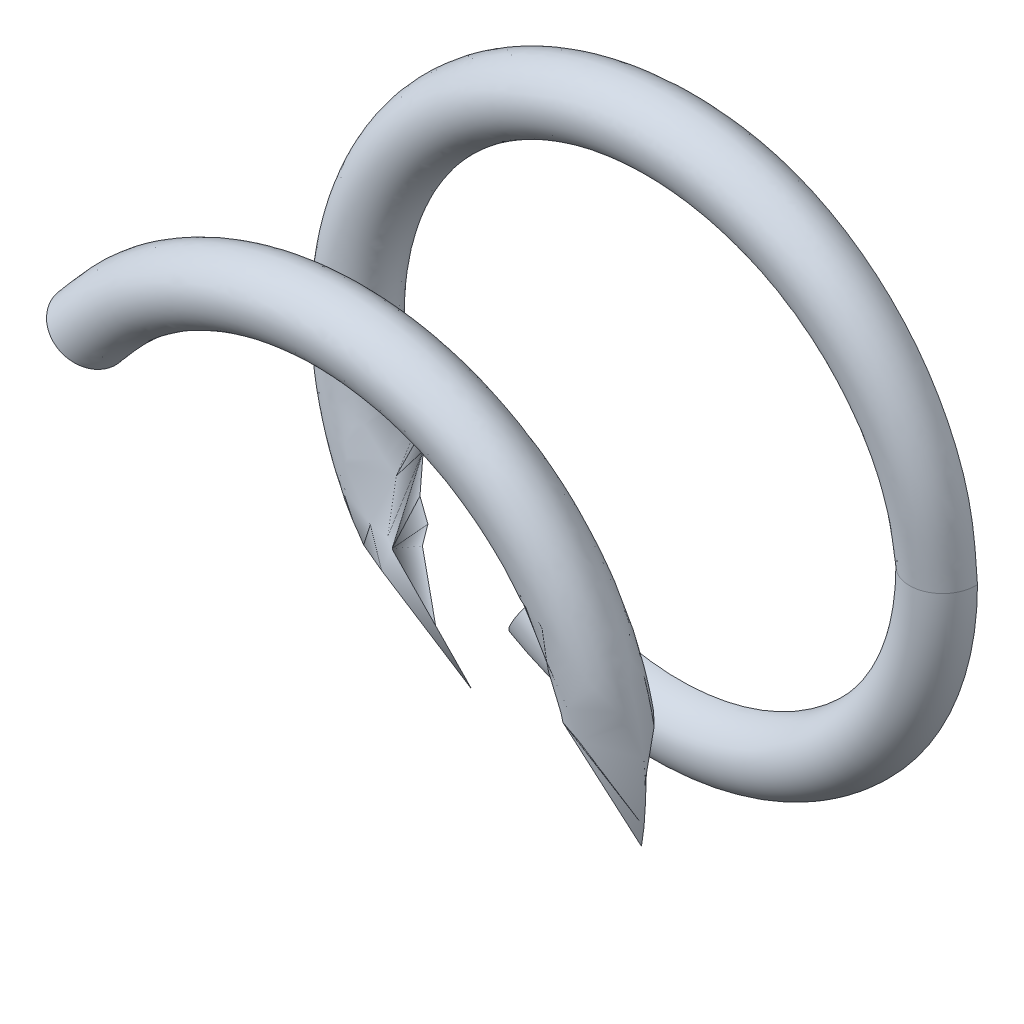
ISO-10303-21;
HEADER;
FILE_DESCRIPTION(('STEP AP214'),'2;1');
FILE_NAME('part.step','',(''),(''),'','','');
FILE_SCHEMA(('AUTOMOTIVE_DESIGN { 1 0 10303 214 1 1 1 1 }'));
ENDSEC;
DATA;
#1=APPLICATION_CONTEXT('core data for automotive mechanical design processes');
#2=APPLICATION_PROTOCOL_DEFINITION('international standard','automotive_design',2000,#1);
#3=PRODUCT_CONTEXT('',#1,'mechanical');
#4=PRODUCT('Part','Part','',(#3));
#5=PRODUCT_RELATED_PRODUCT_CATEGORY('part','',(#4));
#6=PRODUCT_DEFINITION_FORMATION('','',#4);
#7=PRODUCT_DEFINITION_CONTEXT('part definition',#1,'design');
#8=PRODUCT_DEFINITION('design','',#6,#7);
#9=PRODUCT_DEFINITION_SHAPE('','',#8);
#10=(LENGTH_UNIT() NAMED_UNIT(*) SI_UNIT(.MILLI.,.METRE.));
#11=(NAMED_UNIT(*) PLANE_ANGLE_UNIT() SI_UNIT($,.RADIAN.));
#12=(NAMED_UNIT(*) SI_UNIT($,.STERADIAN.) SOLID_ANGLE_UNIT());
#13=UNCERTAINTY_MEASURE_WITH_UNIT(LENGTH_MEASURE(1.E-05),#10,'distance_accuracy_value','');
#14=(GEOMETRIC_REPRESENTATION_CONTEXT(3) GLOBAL_UNCERTAINTY_ASSIGNED_CONTEXT((#13)) GLOBAL_UNIT_ASSIGNED_CONTEXT((#10,
#11,#12)) REPRESENTATION_CONTEXT('',''));
#15=CARTESIAN_POINT('',(0.,0.,0.));
#16=DIRECTION('',(0.,0.,1.));
#17=DIRECTION('',(1.,0.,0.));
#18=AXIS2_PLACEMENT_3D('',#15,#16,#17);
#19=CARTESIAN_POINT('',(12.,0.,1.5));
#20=CARTESIAN_POINT('',(11.9418927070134,0.888508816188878,1.55892430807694));
#21=CARTESIAN_POINT('',(11.8254807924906,2.66854376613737,1.67697302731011));
#22=CARTESIAN_POINT('',(10.9146193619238,5.20828516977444,1.85413695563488));
#23=CARTESIAN_POINT('',(9.50351753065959,7.49108137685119,2.0312750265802));
#24=CARTESIAN_POINT('',(7.612969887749,9.4020238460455,2.20834408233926));
#25=CARTESIAN_POINT('',(5.35173785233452,10.8517466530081,2.3853875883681));
#26=CARTESIAN_POINT('',(2.8241644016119,11.7636999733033,2.56252409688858));
#27=CARTESIAN_POINT('',(0.158422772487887,12.0990888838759,2.73957486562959));
#28=CARTESIAN_POINT('',(-2.51533122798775,11.8334460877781,2.91666327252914));
#29=CARTESIAN_POINT('',(-5.0656074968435,10.9883084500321,3.09375974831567));
#30=CARTESIAN_POINT('',(-7.36509357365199,9.59829820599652,3.27081824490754));
#31=CARTESIAN_POINT('',(-9.30210830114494,7.73654640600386,3.44793628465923));
#32=CARTESIAN_POINT('',(-10.7805494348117,5.49293821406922,3.62497834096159));
#33=CARTESIAN_POINT('',(-11.7258602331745,2.97799692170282,3.8021033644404));
#34=CARTESIAN_POINT('',(-12.0958270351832,0.31675811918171,3.97915157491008));
#35=CARTESIAN_POINT('',(-11.8653071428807,-2.3601936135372,4.15625805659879));
#36=CARTESIAN_POINT('',(-11.0539405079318,-4.92146957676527,4.33333370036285));
#37=CARTESIAN_POINT('',(-9.69359276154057,-7.2386166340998,4.51040787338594));
#38=CARTESIAN_POINT('',(-7.85793807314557,-9.20036793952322,4.68751556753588));
#39=CARTESIAN_POINT('',(-5.63336414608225,-10.7073455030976,4.86456316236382));
#40=CARTESIAN_POINT('',(-3.13134399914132,-11.6862177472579,5.04168825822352));
#41=CARTESIAN_POINT('',(-0.475027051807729,-12.0903507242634,5.21873018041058));
#42=CARTESIAN_POINT('',(2.2046758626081,-11.8952806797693,5.39584853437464));
#43=CARTESIAN_POINT('',(4.77640624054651,-11.1174868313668,5.57290865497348));
#44=CARTESIAN_POINT('',(7.11097475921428,-9.7873304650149,5.74999960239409));
#45=CARTESIAN_POINT('',(9.09701650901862,-7.97795538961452,5.92709199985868));
#46=CARTESIAN_POINT('',(10.6323245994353,-5.77282598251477,6.10415094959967));
#47=CARTESIAN_POINT('',(11.6446337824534,-3.28417762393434,6.28127007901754));
#48=CARTESIAN_POINT('',(12.0827018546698,-0.633204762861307,6.45831173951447));
#49=CARTESIAN_POINT('',(11.9233675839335,2.04880154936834,6.63543656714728));
#50=CARTESIAN_POINT('',(11.1789246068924,4.63044315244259,6.81248492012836));
#51=CARTESIAN_POINT('',(9.87952006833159,6.98219921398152,6.98959141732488));
#52=CARTESIAN_POINT('',(8.09653525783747,8.9920289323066,7.16666702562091));
#53=CARTESIAN_POINT('',(5.91132700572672,10.5555447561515,7.34374120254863));
#54=CARTESIAN_POINT('',(3.43645684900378,11.6010656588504,7.52084890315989));
#55=CARTESIAN_POINT('',(0.791264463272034,12.0729424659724,7.69789649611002));
#56=CARTESIAN_POINT('',(-1.89258789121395,11.9495234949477,7.87502159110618));
#57=CARTESIAN_POINT('',(-4.48362986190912,11.2382958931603,8.05206351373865));
#58=CARTESIAN_POINT('',(-6.85231815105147,9.97015717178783,8.22918186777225));
#59=CARTESIAN_POINT('',(-8.88535349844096,8.21359015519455,8.40624198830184));
#60=CARTESIAN_POINT('',(-10.4770646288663,6.04887728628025,8.58333293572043));
#61=CARTESIAN_POINT('',(-11.5554649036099,3.5881349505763,8.76042533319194));
#62=CARTESIAN_POINT('',(-12.0611317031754,0.949182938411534,8.93748428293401));
#63=CARTESIAN_POINT('',(-11.9736976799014,-1.73605370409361,9.11460341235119));
#64=CARTESIAN_POINT('',(-11.2956449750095,-4.33601625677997,9.29164507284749));
#65=CARTESIAN_POINT('',(-10.0592156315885,-6.72134385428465,9.46876990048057));
#66=CARTESIAN_POINT('',(-8.32908489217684,-8.77699857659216,9.64581825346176));
#67=CARTESIAN_POINT('',(-6.18547441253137,-10.3969192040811,9.8229247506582));
#68=CARTESIAN_POINT('',(-3.7391653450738,-11.5077847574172,10.0000003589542));
#69=CARTESIAN_POINT('',(-1.10693909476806,-12.0473232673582,10.177074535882));
#70=CARTESIAN_POINT('',(1.57921895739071,-11.9958337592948,10.3541822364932));
#71=CARTESIAN_POINT('',(4.18765203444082,-11.3510180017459,10.5312298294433));
#72=CARTESIAN_POINT('',(6.5892741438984,-10.1466480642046,10.7083549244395));
#73=CARTESIAN_POINT('',(8.66702643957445,-8.44303760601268,10.885396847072));
#74=CARTESIAN_POINT('',(10.3151323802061,-6.3211029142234,11.0625152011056));
#75=CARTESIAN_POINT('',(11.4579424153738,-3.88948912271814,11.2395753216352));
#76=CARTESIAN_POINT('',(12.0315748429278,-1.26451827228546,11.4166662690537));
#77=CARTESIAN_POINT('',(12.0158684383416,1.42210661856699,11.5937586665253));
#78=CARTESIAN_POINT('',(11.4044595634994,4.03858245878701,11.7708176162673));
#79=CARTESIAN_POINT('',(10.2324004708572,6.45610557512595,11.9479367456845));
#80=CARTESIAN_POINT('',(8.55546846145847,8.55550067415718,12.1249784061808));
#81=CARTESIAN_POINT('',(6.45573391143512,10.2317047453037,12.3021032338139));
#82=CARTESIAN_POINT('',(4.03907073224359,11.4059312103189,12.4791515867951));
#83=CARTESIAN_POINT('',(1.42190403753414,12.0139174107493,12.6562580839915));
#84=CARTESIAN_POINT('',(-1.26474022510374,12.0337400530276,12.8333336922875));
#85=CARTESIAN_POINT('',(-3.88884864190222,11.4560101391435,13.0104078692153));
#86=CARTESIAN_POINT('',(-6.32183345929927,10.3164132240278,13.1875155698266));
#87=CARTESIAN_POINT('',(-8.44248545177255,8.66639940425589,13.3645631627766));
#88=CARTESIAN_POINT('',(-10.1466150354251,6.58932500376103,13.5416882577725));
#89=CARTESIAN_POINT('',(-11.3518154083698,4.18790141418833,13.7187301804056));
#90=CARTESIAN_POINT('',(-11.9943665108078,1.57907253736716,13.8958485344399));
#91=CARTESIAN_POINT('',(-12.0493489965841,-1.10713991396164,14.0729086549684));
#92=CARTESIAN_POINT('',(-11.5057164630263,-3.73848743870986,14.24999960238));
#93=CARTESIAN_POINT('',(-10.3986191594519,-6.18645303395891,14.4270919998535));
#94=CARTESIAN_POINT('',(-8.77585275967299,-8.32804026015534,14.6041509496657));
#95=CARTESIAN_POINT('',(-6.72182826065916,-10.0598381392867,14.7812700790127));
#96=CARTESIAN_POINT('',(-4.33597372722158,-11.2956612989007,14.9583117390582));
#97=CARTESIAN_POINT('',(-1.73599715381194,-11.9729109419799,15.1354365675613));
#98=CARTESIAN_POINT('',(0.949335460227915,-12.0626747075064,15.3124849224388));
#99=CARTESIAN_POINT('',(3.58752645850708,-11.5536001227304,15.4895914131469));
#100=CARTESIAN_POINT('',(6.04996074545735,-10.4789525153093,15.6666670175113));
#101=CARTESIAN_POINT('',(8.21221908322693,-8.88384871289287,15.8437412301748));
#102=CARTESIAN_POINT('',(9.9713452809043,-6.85319072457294,16.0208489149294));
#103=CARTESIAN_POINT('',(11.2375374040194,-4.48328224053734,16.1978963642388));
#104=CARTESIAN_POINT('',(11.9495143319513,-1.89264831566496,16.3750216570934));
#105=CARTESIAN_POINT('',(12.0737655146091,0.791361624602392,16.5520639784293));
#106=CARTESIAN_POINT('',(11.5996708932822,3.43599518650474,16.7291812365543));
#107=CARTESIAN_POINT('',(10.5573384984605,5.91234692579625,16.9062409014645));
#108=CARTESIAN_POINT('',(8.99037772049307,8.09504304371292,17.0833359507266));
#109=CARTESIAN_POINT('',(6.98332136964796,9.88105914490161,17.2604257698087));
#110=CARTESIAN_POINT('',(4.62994918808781,11.1777062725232,17.4374753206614));
#111=CARTESIAN_POINT('',(2.04876537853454,11.9241713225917,17.6146127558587));
#112=CARTESIAN_POINT('',(-0.632669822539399,12.0816416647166,17.7916559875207));
#113=CARTESIAN_POINT('',(-3.28525807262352,11.6459653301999,17.9687245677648));
#114=CARTESIAN_POINT('',(-5.76915230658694,10.6299279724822,18.1458636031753));
#115=CARTESIAN_POINT('',(-7.99811145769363,9.10921097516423,18.3230262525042));
#116=CARTESIAN_POINT('',(-9.13869069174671,7.73781643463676,18.4410755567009));
#117=CARTESIAN_POINT('',(-9.70801192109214,7.0532835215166,18.4999999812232));
#118=CARTESIAN_POINT('',(15.,0.,1.5));
#119=CARTESIAN_POINT('',(14.9276553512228,1.11042856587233,1.55878513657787));
#120=CARTESIAN_POINT('',(14.7827203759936,3.33505664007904,1.67655504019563));
#121=CARTESIAN_POINT('',(13.6429238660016,6.5105284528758,1.85534896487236));
#122=CARTESIAN_POINT('',(11.8807197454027,9.3626606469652,2.03101922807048));
#123=CARTESIAN_POINT('',(9.51290570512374,11.7553577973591,2.20904237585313));
#124=CARTESIAN_POINT('',(6.69387271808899,13.5624791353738,2.38486552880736));
#125=CARTESIAN_POINT('',(3.52747304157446,14.7059321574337,2.56347098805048));
#126=CARTESIAN_POINT('',(0.199783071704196,15.1233519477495,2.73935694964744));
#127=CARTESIAN_POINT('',(-3.14423055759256,14.7925656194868,2.91687073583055));
#128=CARTESIAN_POINT('',(-6.33358695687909,13.7342622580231,3.09441074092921));
#129=CARTESIAN_POINT('',(-9.20437195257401,11.9999969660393,3.27049082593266));
#130=CARTESIAN_POINT('',(-11.6301986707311,9.66762446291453,3.44895475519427));
#131=CARTESIAN_POINT('',(-13.4738219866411,6.869902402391,3.62439605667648));
#132=CARTESIAN_POINT('',(-14.6586718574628,3.71898281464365,3.80308516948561));
#133=CARTESIAN_POINT('',(-15.1193433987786,0.399199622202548,3.97874576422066));
#134=CARTESIAN_POINT('',(-14.8320557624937,-2.95186917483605,4.15679993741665));
#135=CARTESIAN_POINT('',(-13.8170019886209,-6.15164800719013,4.33357133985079));
#136=CARTESIAN_POINT('',(-12.1184562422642,-9.04740467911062,4.51034039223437));
#137=CARTESIAN_POINT('',(-9.81982226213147,-11.502423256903,4.6883952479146));
#138=CARTESIAN_POINT('',(-7.0451667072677,-13.3826505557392,4.86405793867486));
#139=CARTESIAN_POINT('',(-3.91024372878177,-14.609069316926,5.04274627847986));
#140=CARTESIAN_POINT('',(-0.597783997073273,-15.1126021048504,5.2181775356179));
#141=CARTESIAN_POINT('',(2.75875004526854,-14.8691846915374,5.3966524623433));
#142=CARTESIAN_POINT('',(5.96855784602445,-13.897194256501,5.57276744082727));
#143=CARTESIAN_POINT('',(8.88913913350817,-12.2347932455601,5.75023694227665));
#144=CARTESIAN_POINT('',(11.3722609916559,-9.97075780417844,5.92770789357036));
#145=CARTESIAN_POINT('',(13.2894409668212,-7.21879822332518,6.10382170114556));
#146=CARTESIAN_POINT('',(14.5568913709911,-4.10138542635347,6.28229740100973));
#147=CARTESIAN_POINT('',(15.1031904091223,-0.795669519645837,6.45772840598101));
#148=CARTESIAN_POINT('',(14.9040104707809,2.56475868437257,6.63641647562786));
#149=CARTESIAN_POINT('',(13.9745762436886,5.78490406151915,6.81207987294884));
#150=CARTESIAN_POINT('',(12.3491236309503,8.72940711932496,6.99013357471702));
#151=CARTESIAN_POINT('',(10.120358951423,11.2396911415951,7.16690436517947));
#152=CARTESIAN_POINT('',(7.39084961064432,13.1942357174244,7.34367372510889));
#153=CARTESIAN_POINT('',(4.29239696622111,14.5020680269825,7.5217286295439));
#154=CARTESIAN_POINT('',(0.992865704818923,15.0911870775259,7.69739126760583));
#155=CARTESIAN_POINT('',(-2.36985841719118,14.936488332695,7.87607960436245));
#156=CARTESIAN_POINT('',(-5.60074619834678,14.0491896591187,8.05151087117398));
#157=CARTESIAN_POINT('',(-8.56808583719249,12.4615914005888,8.2299857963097));
#158=CARTESIAN_POINT('',(-11.1050470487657,10.2680875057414,8.40610077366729));
#159=CARTESIAN_POINT('',(-13.0969714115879,7.56150118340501,8.5835702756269));
#160=CARTESIAN_POINT('',(-14.4445499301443,4.48322524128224,8.7610412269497));
#161=CARTESIAN_POINT('',(-15.0766581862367,1.18939771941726,8.9371550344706));
#162=CARTESIAN_POINT('',(-14.9665657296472,-2.17401910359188,9.11563073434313));
#163=CARTESIAN_POINT('',(-14.1210789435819,-5.41614069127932,9.29106173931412));
#164=CARTESIAN_POINT('',(-12.5723097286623,-8.40503083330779,9.46974980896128));
#165=CARTESIAN_POINT('',(-10.4134781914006,-10.9687450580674,9.64541320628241));
#166=CARTESIAN_POINT('',(-7.73091605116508,-12.9975513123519,9.82346690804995));
#167=CARTESIAN_POINT('',(-4.67381370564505,-14.3842896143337,10.0002376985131));
#168=CARTESIAN_POINT('',(-1.3852979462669,-15.0596634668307,10.1770070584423));
#169=CARTESIAN_POINT('',(1.97722271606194,-14.9941735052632,10.3550619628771));
#170=CARTESIAN_POINT('',(5.23111081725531,-14.1903202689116,10.5307246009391));
#171=CARTESIAN_POINT('',(8.24019051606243,-12.6812528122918,10.7094129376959));
#172=CARTESIAN_POINT('',(10.8308564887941,-10.556544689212,10.8848442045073));
#173=CARTESIAN_POINT('',(12.8959217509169,-7.89927574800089,11.0633191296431));
#174=CARTESIAN_POINT('',(14.3213727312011,-4.86353514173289,11.2394341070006));
#175=CARTESIAN_POINT('',(15.0402183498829,-1.58075687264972,11.4169036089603));
#176=CARTESIAN_POINT('',(15.0192449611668,1.77949769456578,11.594374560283));
#177=CARTESIAN_POINT('',(14.2569842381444,5.04566045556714,11.7704883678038));
#178=CARTESIAN_POINT('',(12.7883849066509,8.0735159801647,11.9489640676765));
#179=CARTESIAN_POINT('',(10.6973046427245,10.6914509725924,12.1243950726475));
#180=CARTESIAN_POINT('',(8.06674241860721,12.7919967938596,12.3030831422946));
#181=CARTESIAN_POINT('',(5.0517951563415,14.2559903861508,12.4787465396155));
#182=CARTESIAN_POINT('',(1.77596285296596,15.0183008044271,12.6568002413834));
#183=CARTESIAN_POINT('',(-1.58087639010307,15.0417137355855,12.8335710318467));
#184=CARTESIAN_POINT('',(-4.85978431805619,14.3211385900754,13.0103403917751));
#185=CARTESIAN_POINT('',(-7.90496262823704,12.893650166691,13.1883952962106));
#186=CARTESIAN_POINT('',(-10.5505807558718,10.8358181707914,13.3640579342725));
#187=CARTESIAN_POINT('',(-12.6857188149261,8.233313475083,13.542746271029));
#188=CARTESIAN_POINT('',(-14.1882132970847,5.23857723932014,13.7181775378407));
#189=CARTESIAN_POINT('',(-14.9939356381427,1.9711035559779,13.896652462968));
#190=CARTESIAN_POINT('',(-15.0614029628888,-1.38196663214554,14.0727674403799));
#191=CARTESIAN_POINT('',(-14.3828748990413,-4.67331466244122,14.2502369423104));
#192=CARTESIAN_POINT('',(-12.9969760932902,-7.73452931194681,14.4277078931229));
#193=CARTESIAN_POINT('',(-10.9721481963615,-10.4082780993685,14.6038217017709));
#194=CARTESIAN_POINT('',(-8.39897614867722,-12.5770286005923,14.7822974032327));
#195=CARTESIAN_POINT('',(-5.42386918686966,-14.1181122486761,14.9577283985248));
#196=CARTESIAN_POINT('',(-2.16636208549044,-14.9671103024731,15.1364164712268));
#197=CARTESIAN_POINT('',(1.18338918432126,-15.0782454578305,15.3120799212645));
#198=CARTESIAN_POINT('',(4.48607049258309,-14.4422496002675,15.4901335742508));
#199=CARTESIAN_POINT('',(7.56221853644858,-13.0982890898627,15.6669040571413));
#200=CARTESIAN_POINT('',(10.2645657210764,-11.1063586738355,15.8436740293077));
#201=CARTESIAN_POINT('',(12.4658624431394,-8.56369710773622,16.0217294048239));
#202=CARTESIAN_POINT('',(14.0457602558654,-5.60770580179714,16.1973892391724));
#203=CARTESIAN_POINT('',(14.9377719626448,-2.36175805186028,16.3760786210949));
#204=CARTESIAN_POINT('',(15.0922913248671,0.985188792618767,16.5515201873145));
#205=CARTESIAN_POINT('',(14.4993710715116,4.29787737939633,16.7299833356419));
#206=CARTESIAN_POINT('',(13.1972008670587,7.38854503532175,16.9060645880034));
#207=CARTESIAN_POINT('',(11.2385179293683,10.1193375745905,17.0836031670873));
#208=CARTESIAN_POINT('',(8.72750137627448,12.3520334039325,17.2611183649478));
#209=CARTESIAN_POINT('',(5.79039247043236,13.9714035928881,17.4370031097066));
#210=CARTESIAN_POINT('',(2.55631396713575,14.9060820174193,17.6156094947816));
#211=CARTESIAN_POINT('',(-0.786463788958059,15.1022845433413,17.7914323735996));
#212=CARTESIAN_POINT('',(-4.1083363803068,14.5573982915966,17.9694550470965));
#213=CARTESIAN_POINT('',(-7.21093180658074,13.2871361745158,18.1451262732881));
#214=CARTESIAN_POINT('',(-9.99877614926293,11.3866756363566,18.3239189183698));
#215=CARTESIAN_POINT('',(-11.4237615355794,9.67236469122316,18.4416894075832));
#216=CARTESIAN_POINT('',(-12.1350443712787,8.81666472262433,18.5004746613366));
#217=CARTESIAN_POINT('',(15.,0.,-1.5));
#218=CARTESIAN_POINT('',(14.9275300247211,1.11037306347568,-1.44121487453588));
#219=CARTESIAN_POINT('',(14.782343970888,3.3348899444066,-1.32344499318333));
#220=CARTESIAN_POINT('',(13.6439737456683,6.51112453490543,-1.14465089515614));
#221=CARTESIAN_POINT('',(11.880549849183,9.36247980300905,-0.968980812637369));
#222=CARTESIAN_POINT('',(9.51333714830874,11.7559009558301,-0.790957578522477));
#223=CARTESIAN_POINT('',(6.69360174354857,13.5620400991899,-0.615134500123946));
#224=CARTESIAN_POINT('',(3.52775582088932,14.7068335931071,-0.436528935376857));
#225=CARTESIAN_POINT('',(0.199669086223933,15.1231403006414,-0.260643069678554));
#226=CARTESIAN_POINT('',(-3.14415932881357,14.7927948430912,-0.0831292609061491));
#227=CARTESIAN_POINT('',(-6.33396481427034,13.7348041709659,0.0944107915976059));
#228=CARTESIAN_POINT('',(-9.20412122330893,11.999786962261,0.270490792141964));
#229=CARTESIAN_POINT('',(-11.6310085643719,9.66823422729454,0.448954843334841));
#230=CARTESIAN_POINT('',(-13.4733161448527,6.86963617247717,0.624396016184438));
#231=CARTESIAN_POINT('',(-14.6596092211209,3.71925552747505,0.803085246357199));
#232=CARTESIAN_POINT('',(-15.1189474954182,0.399102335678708,0.978745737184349));
#233=CARTESIAN_POINT('',(-14.8326056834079,-2.95187546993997,1.15679996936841));
#234=CARTESIAN_POINT('',(-13.8171704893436,-6.1518585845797,1.33357135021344));
#235=CARTESIAN_POINT('',(-12.1184670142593,-9.04728629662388,1.51034037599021));
#236=CARTESIAN_POINT('',(-9.82032474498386,-11.5031462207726,1.6883953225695));
#237=CARTESIAN_POINT('',(-7.04496655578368,-13.3821963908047,1.86405789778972));
#238=CARTESIAN_POINT('',(-3.91050789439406,-14.6100868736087,2.04274636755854));
#239=CARTESIAN_POINT('',(-0.597713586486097,-15.1120615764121,2.21817750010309));
#240=CARTESIAN_POINT('',(2.75882553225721,-14.8699840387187,2.39665251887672));
#241=CARTESIAN_POINT('',(5.96860870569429,-13.8970237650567,2.57276742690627));
#242=CARTESIAN_POINT('',(8.88918793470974,-12.2350536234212,2.75023694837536));
#243=CARTESIAN_POINT('',(11.3727988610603,-9.97107743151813,2.92770793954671));
#244=CARTESIAN_POINT('',(13.2891244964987,-7.21870820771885,3.10382166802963));
#245=CARTESIAN_POINT('',(14.5578879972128,-4.1016147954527,3.28229749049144));
#246=CARTESIAN_POINT('',(15.1026189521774,-0.795632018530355,3.45772836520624));
#247=CARTESIAN_POINT('',(14.9049758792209,2.56489033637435,3.63641655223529));
#248=CARTESIAN_POINT('',(13.9741756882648,5.78483223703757,3.81207984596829));
#249=CARTESIAN_POINT('',(12.3496236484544,8.72963673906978,3.99013360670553));
#250=CARTESIAN_POINT('',(10.1204270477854,11.2399518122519,4.16690437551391));
#251=CARTESIAN_POINT('',(7.3909076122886,13.1941319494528,4.34367370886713));
#252=CARTESIAN_POINT('',(4.29256195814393,14.5029329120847,4.5217287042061));
#253=CARTESIAN_POINT('',(0.992867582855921,15.090690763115,4.69739122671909));
#254=CARTESIAN_POINT('',(-2.37003096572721,14.9375253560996,4.87607969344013));
#255=CARTESIAN_POINT('',(-5.60059066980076,14.0486672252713,5.05151083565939));
#256=CARTESIAN_POINT('',(-8.56847992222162,12.4622909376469,5.22998585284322));
#257=CARTESIAN_POINT('',(-11.1050241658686,10.267911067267,5.40610075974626));
#258=CARTESIAN_POINT('',(-13.0971218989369,7.56171920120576,5.58357028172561));
#259=CARTESIAN_POINT('',(-14.4451713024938,4.48329846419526,5.76104127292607));
#260=CARTESIAN_POINT('',(-15.0763324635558,1.18944420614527,5.93715500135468));
#261=CARTESIAN_POINT('',(-14.9675694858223,-2.17421492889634,6.11563082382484));
#262=CARTESIAN_POINT('',(-14.1205416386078,-5.41594251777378,6.29106169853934));
#263=CARTESIAN_POINT('',(-12.5731381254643,-8.4055437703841,6.46974988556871));
#264=CARTESIAN_POINT('',(-10.4131414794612,-10.9685165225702,6.64541317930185));
#265=CARTESIAN_POINT('',(-7.73127944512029,-12.9979644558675,6.82346694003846));
#266=CARTESIAN_POINT('',(-4.67376989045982,-14.3845554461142,7.00023770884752));
#267=CARTESIAN_POINT('',(-1.38539313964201,-15.0595922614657,7.17700704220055));
#268=CARTESIAN_POINT('',(1.97742376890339,-14.9950307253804,7.35506203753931));
#269=CARTESIAN_POINT('',(5.23090723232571,-14.1898676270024,7.53072456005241));
#270=CARTESIAN_POINT('',(8.24076994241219,-12.6821299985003,7.70941302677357));
#271=CARTESIAN_POINT('',(10.8305019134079,-10.5561306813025,7.88484416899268));
#272=CARTESIAN_POINT('',(12.8965662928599,-7.89975451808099,8.06331918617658));
#273=CARTESIAN_POINT('',(14.3212800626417,-4.86338326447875,8.23943409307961));
#274=CARTESIAN_POINT('',(15.0404445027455,-1.58089483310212,8.41690361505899));
#275=CARTESIAN_POINT('',(15.0198423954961,1.77968353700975,8.5943746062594));
#276=CARTESIAN_POINT('',(14.2567055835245,5.04548550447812,8.7704883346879));
#277=CARTESIAN_POINT('',(12.7892222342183,8.07410313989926,8.94896415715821));
#278=CARTESIAN_POINT('',(10.6968943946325,10.6910513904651,9.12439503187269));
#279=CARTESIAN_POINT('',(8.06729056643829,12.7928023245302,9.30308321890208));
#280=CARTESIAN_POINT('',(5.05158050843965,14.2556446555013,9.47874651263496));
#281=CARTESIAN_POINT('',(1.77612678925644,15.0188260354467,9.65680027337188));
#282=CARTESIAN_POINT('',(-1.58102454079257,15.0419387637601,9.83357104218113));
#283=CARTESIAN_POINT('',(-4.8596683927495,14.3211122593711,10.0103403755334));
#284=CARTESIAN_POINT('',(-7.90549496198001,12.8943515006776,10.1883953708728));
#285=CARTESIAN_POINT('',(-10.5502106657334,10.8354874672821,10.3640578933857));
#286=CARTESIAN_POINT('',(-12.6866049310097,8.23387915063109,10.5427463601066));
#287=CARTESIAN_POINT('',(-14.1877209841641,5.23834324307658,10.7181775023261));
#288=CARTESIAN_POINT('',(-14.9947191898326,1.97127877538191,10.8966525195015));
#289=CARTESIAN_POINT('',(-15.0612565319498,-1.38206768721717,11.0727674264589));
#290=CARTESIAN_POINT('',(-14.3831376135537,-4.67328061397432,11.2502369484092));
#291=CARTESIAN_POINT('',(-12.9974462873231,-7.73494208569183,11.4277079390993));
#292=CARTESIAN_POINT('',(-10.971964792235,-10.4080049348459,11.603821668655));
#293=CARTESIAN_POINT('',(-8.3995022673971,-12.577905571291,11.7822974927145));
#294=CARTESIAN_POINT('',(-5.42365692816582,-14.1175803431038,11.9577283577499));
#295=CARTESIAN_POINT('',(-2.1665352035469,-14.9680691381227,12.1364165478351));
#296=CARTESIAN_POINT('',(1.18344465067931,-15.0778423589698,12.3120798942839));
#297=CARTESIAN_POINT('',(4.48613437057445,-14.4427961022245,12.4901336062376));
#298=CARTESIAN_POINT('',(7.56244527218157,-13.0984341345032,12.6669040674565));
#299=CARTESIAN_POINT('',(10.264449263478,-11.106382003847,12.843674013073));
#300=CARTESIAN_POINT('',(12.4666346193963,-8.5641217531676,13.0217294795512));
#301=CARTESIAN_POINT('',(14.0452859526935,-5.60755337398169,13.1973891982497));
#302=CARTESIAN_POINT('',(14.9388105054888,-2.36191421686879,13.3760787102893));
#303=CARTESIAN_POINT('',(15.0917553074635,0.985202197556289,13.5515201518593));
#304=CARTESIAN_POINT('',(14.500156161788,4.29803627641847,13.7299833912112));
#305=CARTESIAN_POINT('',(13.1969943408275,7.38856229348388,13.9060645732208));
#306=CARTESIAN_POINT('',(11.2387965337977,10.1194305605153,14.0836031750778));
#307=CARTESIAN_POINT('',(8.7278095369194,12.352662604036,14.2611184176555));
#308=CARTESIAN_POINT('',(5.79027500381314,13.9709501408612,14.4370030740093));
#309=CARTESIAN_POINT('',(2.5564331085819,14.9070682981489,14.6156095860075));
#310=CARTESIAN_POINT('',(-0.786458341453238,15.1020694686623,14.7914323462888));
#311=CARTESIAN_POINT('',(-4.10849776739,14.5581051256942,14.9694550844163));
#312=CARTESIAN_POINT('',(-7.21066093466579,13.2864572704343,15.1451262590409));
#313=CARTESIAN_POINT('',(-9.9992992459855,11.3873920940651,15.3239189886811));
#314=CARTESIAN_POINT('',(-11.4241918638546,9.67278935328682,15.4416894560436));
#315=CARTESIAN_POINT('',(-12.1354283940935,8.81694373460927,15.5004746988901));
#316=CARTESIAN_POINT('',(12.,0.,-1.5));
#317=CARTESIAN_POINT('',(11.9417673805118,0.888453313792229,-1.44107570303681));
#318=CARTESIAN_POINT('',(11.825104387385,2.66837707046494,-1.32302700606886));
#319=CARTESIAN_POINT('',(10.9156692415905,5.20888125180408,-1.14586290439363));
#320=CARTESIAN_POINT('',(9.50334763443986,7.49090053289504,-0.968725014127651));
#321=CARTESIAN_POINT('',(7.613401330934,9.40256700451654,-0.791655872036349));
#322=CARTESIAN_POINT('',(5.3514668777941,10.8513076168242,-0.614612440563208));
#323=CARTESIAN_POINT('',(2.82444718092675,11.7646014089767,-0.437475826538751));
#324=CARTESIAN_POINT('',(0.158308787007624,12.0988772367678,-0.260425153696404));
#325=CARTESIAN_POINT('',(-2.51525999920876,11.8336753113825,-0.0833367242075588));
#326=CARTESIAN_POINT('',(-5.06598535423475,10.9888503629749,0.0937597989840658));
#327=CARTESIAN_POINT('',(-7.36484284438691,9.59808820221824,0.270818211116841));
#328=CARTESIAN_POINT('',(-9.30291819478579,7.73715617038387,0.4479363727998));
#329=CARTESIAN_POINT('',(-10.7800435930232,5.4926719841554,0.624978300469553));
#330=CARTESIAN_POINT('',(-11.7267975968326,2.97826963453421,0.802103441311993));
#331=CARTESIAN_POINT('',(-12.0954311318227,0.316660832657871,0.97915154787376));
#332=CARTESIAN_POINT('',(-11.8658570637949,-2.36019990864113,1.15625808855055));
#333=CARTESIAN_POINT('',(-11.0541090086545,-4.92168015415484,1.3333337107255));
#334=CARTESIAN_POINT('',(-9.69360353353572,-7.23849825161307,1.51040785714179));
#335=CARTESIAN_POINT('',(-7.85844055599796,-9.20109090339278,1.68751564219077));
#336=CARTESIAN_POINT('',(-5.63316399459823,-10.7068913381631,1.86456312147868));
#337=CARTESIAN_POINT('',(-3.13160816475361,-11.6872353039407,2.0416883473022));
#338=CARTESIAN_POINT('',(-0.474956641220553,-12.0898101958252,2.21873014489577));
#339=CARTESIAN_POINT('',(2.20475134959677,-11.8960800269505,2.39584859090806));
#340=CARTESIAN_POINT('',(4.77645710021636,-11.1173163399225,2.57290864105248));
#341=CARTESIAN_POINT('',(7.11102356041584,-9.787590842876,2.74999960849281));
#342=CARTESIAN_POINT('',(9.09755437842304,-7.97827501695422,2.92709204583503));
#343=CARTESIAN_POINT('',(10.6320081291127,-5.77273596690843,3.10415091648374));
#344=CARTESIAN_POINT('',(11.6456304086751,-3.28440699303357,3.28127016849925));
#345=CARTESIAN_POINT('',(12.0821303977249,-0.633167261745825,3.45831169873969));
#346=CARTESIAN_POINT('',(11.9243329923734,2.04893320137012,3.63543664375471));
#347=CARTESIAN_POINT('',(11.1785240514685,4.63037132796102,3.8124848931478));
#348=CARTESIAN_POINT('',(9.88002008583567,6.98242883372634,3.98959144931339));
#349=CARTESIAN_POINT('',(8.09660335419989,8.99228960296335,4.16666703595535));
#350=CARTESIAN_POINT('',(5.911385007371,10.5554409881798,4.34374118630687));
#351=CARTESIAN_POINT('',(3.4366218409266,11.6019305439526,4.5208489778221));
#352=CARTESIAN_POINT('',(0.791266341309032,12.0724461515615,4.69789645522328));
#353=CARTESIAN_POINT('',(-1.89276043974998,11.9505605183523,4.87502168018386));
#354=CARTESIAN_POINT('',(-4.4834743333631,11.2377734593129,5.05206347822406));
#355=CARTESIAN_POINT('',(-6.85271223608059,9.97085670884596,5.22918192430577));
#356=CARTESIAN_POINT('',(-8.88533061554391,8.21341371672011,5.4062419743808));
#357=CARTESIAN_POINT('',(-10.4772151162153,6.049095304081,5.58333294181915));
#358=CARTESIAN_POINT('',(-11.5560862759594,3.58820817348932,5.7604253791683));
#359=CARTESIAN_POINT('',(-12.0608059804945,0.949229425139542,5.93748424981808));
#360=CARTESIAN_POINT('',(-11.9747014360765,-1.73624952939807,6.1146035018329));
#361=CARTESIAN_POINT('',(-11.2951076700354,-4.33581808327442,6.29164503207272));
#362=CARTESIAN_POINT('',(-10.0600440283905,-6.72185679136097,6.468769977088));
#363=CARTESIAN_POINT('',(-8.32874818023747,-8.7767700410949,6.64581822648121));
#364=CARTESIAN_POINT('',(-6.18583780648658,-10.3973323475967,6.82292478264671));
#365=CARTESIAN_POINT('',(-3.73912152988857,-11.5080505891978,7.00000036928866));
#366=CARTESIAN_POINT('',(-1.10703428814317,-12.0472520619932,7.17707451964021));
#367=CARTESIAN_POINT('',(1.57942001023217,-11.996690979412,7.35418231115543));
#368=CARTESIAN_POINT('',(4.18744844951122,-11.3505653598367,7.53122978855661));
#369=CARTESIAN_POINT('',(6.58985357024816,-10.1475252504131,7.70835501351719));
#370=CARTESIAN_POINT('',(8.66667186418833,-8.44262359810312,7.88539681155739));
#371=CARTESIAN_POINT('',(10.3157769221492,-6.32158168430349,8.06251525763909));
#372=CARTESIAN_POINT('',(11.4578497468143,-3.88933724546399,8.23957530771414));
#373=CARTESIAN_POINT('',(12.0318009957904,-1.26465623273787,8.41666627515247));
#374=CARTESIAN_POINT('',(12.0164658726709,1.42229246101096,8.59375871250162));
#375=CARTESIAN_POINT('',(11.4041809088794,4.03840750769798,8.77081758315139));
#376=CARTESIAN_POINT('',(10.2332377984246,6.4566927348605,8.94793683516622));
#377=CARTESIAN_POINT('',(8.55505821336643,8.55510109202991,9.12497836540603));
#378=CARTESIAN_POINT('',(6.45628205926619,10.2325102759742,9.3021033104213));
#379=CARTESIAN_POINT('',(4.03885608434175,11.4055854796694,9.47915155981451));
#380=CARTESIAN_POINT('',(1.42206797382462,12.0144426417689,9.65625811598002));
#381=CARTESIAN_POINT('',(-1.26488837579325,12.0339650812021,9.83333370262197));
#382=CARTESIAN_POINT('',(-3.88873271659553,11.4559838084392,10.0104078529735));
#383=CARTESIAN_POINT('',(-6.32236579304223,10.3171145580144,10.1875156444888));
#384=CARTESIAN_POINT('',(-8.44211536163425,8.66606870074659,10.3645631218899));
#385=CARTESIAN_POINT('',(-10.1475011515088,6.58989067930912,10.5416883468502));
#386=CARTESIAN_POINT('',(-11.3513230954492,4.18766741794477,10.718730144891));
#387=CARTESIAN_POINT('',(-11.9951500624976,1.57924775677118,10.8958485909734));
#388=CARTESIAN_POINT('',(-12.0492025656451,-1.10724096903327,11.0729086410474));
#389=CARTESIAN_POINT('',(-11.5059791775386,-3.73845339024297,11.2499996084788));
#390=CARTESIAN_POINT('',(-10.3990893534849,-6.18686580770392,11.4270920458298));
#391=CARTESIAN_POINT('',(-8.77566935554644,-8.32776709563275,11.6041509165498));
#392=CARTESIAN_POINT('',(-6.72235437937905,-10.0607151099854,11.7812701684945));
#393=CARTESIAN_POINT('',(-4.33576146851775,-11.2951293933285,11.9583116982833));
#394=CARTESIAN_POINT('',(-1.7361702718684,-11.9738697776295,12.1354366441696));
#395=CARTESIAN_POINT('',(0.949390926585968,-12.0622716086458,12.3124848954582));
#396=CARTESIAN_POINT('',(3.58759033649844,-11.5541466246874,12.4895914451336));
#397=CARTESIAN_POINT('',(6.05018748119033,-10.4790975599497,12.6666670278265));
#398=CARTESIAN_POINT('',(8.21210262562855,-8.88387204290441,12.84374121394));
#399=CARTESIAN_POINT('',(9.97211745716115,-6.85361537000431,13.0208489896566));
#400=CARTESIAN_POINT('',(11.2370631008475,-4.48312981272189,13.1978963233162));
#401=CARTESIAN_POINT('',(11.9505528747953,-1.89280448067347,13.3750217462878));
#402=CARTESIAN_POINT('',(12.0732294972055,0.791375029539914,13.5520639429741));
#403=CARTESIAN_POINT('',(11.6004559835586,3.43615408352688,13.7291812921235));
#404=CARTESIAN_POINT('',(10.5571319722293,5.91236418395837,13.9062408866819));
#405=CARTESIAN_POINT('',(8.99065632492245,8.09513602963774,14.0833359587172));
#406=CARTESIAN_POINT('',(6.98362953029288,9.8816883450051,14.2604258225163));
#407=CARTESIAN_POINT('',(4.62983172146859,11.1772528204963,14.4374752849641));
#408=CARTESIAN_POINT('',(2.0488845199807,11.9251576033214,14.6146128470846));
#409=CARTESIAN_POINT('',(-0.632664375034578,12.0814265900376,14.7916559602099));
#410=CARTESIAN_POINT('',(-3.28541945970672,11.6466721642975,14.9687246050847));
#411=CARTESIAN_POINT('',(-5.76888143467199,10.6292490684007,15.1458635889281));
#412=CARTESIAN_POINT('',(-7.9986345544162,9.10992743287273,15.3230263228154));
#413=CARTESIAN_POINT('',(-9.13912102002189,7.73824109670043,15.4410756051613));
#414=CARTESIAN_POINT('',(-9.70839594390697,7.05356253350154,15.5000000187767));
#415=CARTESIAN_POINT('',(9.,0.,-1.5));
#416=CARTESIAN_POINT('',(8.95600473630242,0.666533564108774,-1.44093653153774));
#417=CARTESIAN_POINT('',(8.86786480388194,2.00186419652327,-1.32260901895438));
#418=CARTESIAN_POINT('',(8.18736473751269,3.90663796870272,-1.14707491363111));
#419=CARTESIAN_POINT('',(7.12614541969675,5.61932126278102,-0.968469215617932));
#420=CARTESIAN_POINT('',(5.71346551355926,7.04923305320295,-0.792354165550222));
#421=CARTESIAN_POINT('',(4.00933201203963,8.14057513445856,-0.614090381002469));
#422=CARTESIAN_POINT('',(2.12113854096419,8.82236922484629,-0.438422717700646));
#423=CARTESIAN_POINT('',(0.116948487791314,9.07461417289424,-0.260207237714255));
#424=CARTESIAN_POINT('',(-1.88636066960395,8.87455577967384,-0.0835441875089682));
#425=CARTESIAN_POINT('',(-3.79800589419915,8.24289655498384,0.0931088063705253));
#426=CARTESIAN_POINT('',(-5.52556446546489,7.19638944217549,0.271145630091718));
#427=CARTESIAN_POINT('',(-6.97482782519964,5.80607811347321,0.446917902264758));
#428=CARTESIAN_POINT('',(-8.08677104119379,4.11570779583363,0.625560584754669));
#429=CARTESIAN_POINT('',(-8.79398597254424,2.23728374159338,0.801121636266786));
#430=CARTESIAN_POINT('',(-9.07191476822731,0.234219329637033,0.979557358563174));
#431=CARTESIAN_POINT('',(-8.8991084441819,-1.76852434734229,1.15571620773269));
#432=CARTESIAN_POINT('',(-8.29104752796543,-3.69150172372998,1.33309607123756));
#433=CARTESIAN_POINT('',(-7.26874005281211,-5.42971020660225,1.51047533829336));
#434=CARTESIAN_POINT('',(-5.89655636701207,-6.89903558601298,1.68663596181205));
#435=CARTESIAN_POINT('',(-4.22136143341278,-8.03158628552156,1.86506834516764));
#436=CARTESIAN_POINT('',(-2.35270843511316,-8.76438373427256,2.04063032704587));
#437=CARTESIAN_POINT('',(-0.352199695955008,-9.06755881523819,2.21928278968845));
#438=CARTESIAN_POINT('',(1.65067716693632,-8.92217601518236,2.39504466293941));
#439=CARTESIAN_POINT('',(3.58430549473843,-8.33760891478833,2.57304985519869));
#440=CARTESIAN_POINT('',(5.33285918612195,-7.34012806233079,2.74976226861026));
#441=CARTESIAN_POINT('',(6.82230989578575,-5.98547260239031,2.92647615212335));
#442=CARTESIAN_POINT('',(7.97489176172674,-4.32676372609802,3.10448016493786));
#443=CARTESIAN_POINT('',(8.73337282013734,-2.46719919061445,3.28024284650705));
#444=CARTESIAN_POINT('',(9.06164184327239,-0.470702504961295,3.45889503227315));
#445=CARTESIAN_POINT('',(8.94369010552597,1.53297606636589,3.63445673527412));
#446=CARTESIAN_POINT('',(8.38287241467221,3.47591041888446,3.81288994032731));
#447=CARTESIAN_POINT('',(7.41041652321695,5.2352209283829,3.98904929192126));
#448=CARTESIAN_POINT('',(6.07277966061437,6.74462739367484,4.16642969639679));
#449=CARTESIAN_POINT('',(4.43186240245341,7.91675002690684,4.3438086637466));
#450=CARTESIAN_POINT('',(2.58068172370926,8.70092817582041,4.51996925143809));
#451=CARTESIAN_POINT('',(0.589665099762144,9.05420154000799,4.69840168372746));
#452=CARTESIAN_POINT('',(-1.41548991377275,8.96359568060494,4.87396366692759));
#453=CARTESIAN_POINT('',(-3.36635799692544,8.4268796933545,5.05261612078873));
#454=CARTESIAN_POINT('',(-5.13694454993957,7.47942248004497,5.22837799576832));
#455=CARTESIAN_POINT('',(-6.66563706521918,6.15891636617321,5.40638318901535));
#456=CARTESIAN_POINT('',(-7.85730833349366,4.53647140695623,5.58309560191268));
#457=CARTESIAN_POINT('',(-8.66700124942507,2.69311788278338,5.75980948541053));
#458=CARTESIAN_POINT('',(-9.04527949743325,0.709014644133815,5.93781349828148));
#459=CARTESIAN_POINT('',(-8.98183338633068,-1.2982841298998,6.11357617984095));
#460=CARTESIAN_POINT('',(-8.4696737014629,-3.25569364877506,6.29222836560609));
#461=CARTESIAN_POINT('',(-7.54694993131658,-5.03816981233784,6.46779006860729));
#462=CARTESIAN_POINT('',(-6.24435488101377,-6.58502355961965,6.64622327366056));
#463=CARTESIAN_POINT('',(-4.64039616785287,-7.7967002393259,6.82238262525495));
#464=CARTESIAN_POINT('',(-2.80447316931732,-8.63154573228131,6.9997630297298));
#465=CARTESIAN_POINT('',(-0.828675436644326,-9.03491186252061,7.17714199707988));
#466=CARTESIAN_POINT('',(1.18141625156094,-8.99835123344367,7.35330258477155));
#467=CARTESIAN_POINT('',(3.14398966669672,-8.51126309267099,7.5317350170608));
#468=CARTESIAN_POINT('',(4.93893719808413,-7.61292050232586,7.70729700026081));
#469=CARTESIAN_POINT('',(6.50284181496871,-6.32911651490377,7.88594945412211));
#470=CARTESIAN_POINT('',(7.73498755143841,-4.743408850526,8.0617113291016));
#471=CARTESIAN_POINT('',(8.59441943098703,-2.91529122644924,8.23971652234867));
#472=CARTESIAN_POINT('',(9.02315748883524,-0.948417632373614,8.41642893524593));
#473=CARTESIAN_POINT('',(9.01308934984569,1.06490138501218,8.59314281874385));
#474=CARTESIAN_POINT('',(8.55165623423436,3.03132951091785,8.77114683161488));
#475=CARTESIAN_POINT('',(7.67725336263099,4.83928232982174,8.94690951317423));
#476=CARTESIAN_POINT('',(6.41322203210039,6.41915079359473,9.12556169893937));
#477=CARTESIAN_POINT('',(4.8452735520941,7.67221822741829,9.30112340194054));
#478=CARTESIAN_POINT('',(3.02613166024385,8.55552630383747,9.47955660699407));
#479=CARTESIAN_POINT('',(1.0680091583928,9.01005924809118,9.65571595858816));
#480=CARTESIAN_POINT('',(-0.948752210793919,9.02599139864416,9.83309636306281));
#481=CARTESIAN_POINT('',(-2.91779704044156,8.59085535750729,10.0104753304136));
#482=CARTESIAN_POINT('',(-4.73923662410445,7.73987761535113,10.1866359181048));
#483=CARTESIAN_POINT('',(-6.33402005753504,6.49664993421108,10.365068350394));
#484=CARTESIAN_POINT('',(-7.60839737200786,4.94590220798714,10.5406303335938));
#485=CARTESIAN_POINT('',(-8.51492520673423,3.13699159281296,10.7192827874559));
#486=CARTESIAN_POINT('',(-8.99558093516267,1.18721673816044,10.8950446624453));
#487=CARTESIAN_POINT('',(-9.03714859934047,-0.832414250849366,11.0730498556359));
#488=CARTESIAN_POINT('',(-8.6288207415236,-2.80362616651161,11.2497622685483));
#489=CARTESIAN_POINT('',(-7.80073241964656,-4.63878952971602,11.4264761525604));
#490=CARTESIAN_POINT('',(-6.57937391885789,-6.24752925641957,11.6044801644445));
#491=CARTESIAN_POINT('',(-5.04520649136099,-7.54352464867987,11.7802428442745));
#492=CARTESIAN_POINT('',(-3.24786600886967,-8.4726784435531,11.9588950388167));
#493=CARTESIAN_POINT('',(-1.3058053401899,-8.97967041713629,12.1344567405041));
#494=CARTESIAN_POINT('',(0.715337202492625,-9.04670085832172,12.3128898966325));
#495=CARTESIAN_POINT('',(2.68904630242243,-8.66549714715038,12.4890492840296));
#496=CARTESIAN_POINT('',(4.53792969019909,-7.85976098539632,12.6664299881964));
#497=CARTESIAN_POINT('',(6.15975598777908,-6.66136208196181,12.8438084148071));
#498=CARTESIAN_POINT('',(7.47760029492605,-5.14310898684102,13.019968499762));
#499=CARTESIAN_POINT('',(8.42884024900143,-3.35870625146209,13.1984034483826));
#500=CARTESIAN_POINT('',(8.96229524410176,-1.42369474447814,13.3739647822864));
#501=CARTESIAN_POINT('',(9.05470368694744,0.597547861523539,13.5526077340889));
#502=CARTESIAN_POINT('',(8.70075580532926,2.57427189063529,13.7283791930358));
#503=CARTESIAN_POINT('',(7.91726960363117,4.43616607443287,13.906417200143));
#504=CARTESIAN_POINT('',(6.7425161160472,6.07084149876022,14.0830687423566));
#505=CARTESIAN_POINT('',(5.23944952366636,7.41071408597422,14.2597332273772));
#506=CARTESIAN_POINT('',(3.46938843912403,8.38355550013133,14.4379474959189));
#507=CARTESIAN_POINT('',(1.54133593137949,8.94324690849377,14.6136161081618));
#508=CARTESIAN_POINT('',(-0.478870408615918,9.06078371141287,14.791879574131));
#509=CARTESIAN_POINT('',(-2.46234115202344,8.73523920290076,14.967994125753));
#510=CARTESIAN_POINT('',(-4.32710193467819,7.97204086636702,15.1466009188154));
#511=CARTESIAN_POINT('',(-5.9979698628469,6.83246277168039,15.3221336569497));
#512=CARTESIAN_POINT('',(-6.85405017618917,5.80369284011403,15.4404617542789));
#513=CARTESIAN_POINT('',(-7.28136349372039,5.29018133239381,15.4995253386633));
#514=CARTESIAN_POINT('',(9.,0.,1.5));
#515=CARTESIAN_POINT('',(8.95613006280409,0.666589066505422,1.55906347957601));
#516=CARTESIAN_POINT('',(8.86824120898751,2.00203089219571,1.67739101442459));
#517=CARTESIAN_POINT('',(8.18631485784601,3.90604188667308,1.85292494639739));
#518=CARTESIAN_POINT('',(7.12631531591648,5.61950210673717,2.03153082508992));
#519=CARTESIAN_POINT('',(5.71303407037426,7.04868989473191,2.20764578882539));
#520=CARTESIAN_POINT('',(4.00960298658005,8.14101417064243,2.38590964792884));
#521=CARTESIAN_POINT('',(2.12085576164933,8.82146778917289,2.56157720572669));
#522=CARTESIAN_POINT('',(0.117062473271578,9.07482582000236,2.73979278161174));
#523=CARTESIAN_POINT('',(-1.88643189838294,8.87432655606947,2.91645580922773));
#524=CARTESIAN_POINT('',(-3.7976280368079,8.2423546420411,3.09310875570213));
#525=CARTESIAN_POINT('',(-5.52581519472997,7.19659944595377,3.27114566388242));
#526=CARTESIAN_POINT('',(-6.97401793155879,5.8054683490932,3.44691781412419));
#527=CARTESIAN_POINT('',(-8.08727688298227,4.11597402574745,3.62556062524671));
#528=CARTESIAN_POINT('',(-8.79304860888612,2.23701102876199,3.8011215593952));
#529=CARTESIAN_POINT('',(-9.07231067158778,0.234316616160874,3.97955738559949));
#530=CARTESIAN_POINT('',(-8.89855852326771,-1.76851805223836,4.15571617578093));
#531=CARTESIAN_POINT('',(-8.29087902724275,-3.69129114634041,4.33309606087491));
#532=CARTESIAN_POINT('',(-7.26872928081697,-5.42982858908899,4.51047535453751));
#533=CARTESIAN_POINT('',(-5.89605388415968,-6.89831262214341,4.68663588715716));
#534=CARTESIAN_POINT('',(-4.22156158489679,-8.03204045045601,4.86506838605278));
#535=CARTESIAN_POINT('',(-2.35244426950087,-8.76336617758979,5.04063023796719));
#536=CARTESIAN_POINT('',(-0.352270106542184,-9.06809934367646,5.21928282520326));
#537=CARTESIAN_POINT('',(1.65060167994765,-8.92137666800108,5.39504460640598));
#538=CARTESIAN_POINT('',(3.58425463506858,-8.33777940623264,5.57304986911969));
#539=CARTESIAN_POINT('',(5.33281038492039,-7.33986768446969,5.74976226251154));
#540=CARTESIAN_POINT('',(6.82177202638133,-5.98515297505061,5.926476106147));
#541=CARTESIAN_POINT('',(7.97520823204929,-4.32685374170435,6.10448019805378));
#542=CARTESIAN_POINT('',(8.73237619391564,-2.46696982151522,6.28024275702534));
#543=CARTESIAN_POINT('',(9.06221330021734,-0.470740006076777,6.45889507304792));
#544=CARTESIAN_POINT('',(8.94272469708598,1.53284441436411,6.63445665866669));
#545=CARTESIAN_POINT('',(8.38327297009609,3.47598224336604,6.81288996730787));
#546=CARTESIAN_POINT('',(7.40991650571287,5.23499130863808,6.98904925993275));
#547=CARTESIAN_POINT('',(6.07271156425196,6.7443667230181,7.16642968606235));
#548=CARTESIAN_POINT('',(4.43180440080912,7.91685379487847,7.34380867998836));
#549=CARTESIAN_POINT('',(2.58051673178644,8.70006329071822,7.51996917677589));
#550=CARTESIAN_POINT('',(0.589663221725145,9.05469785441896,7.6984017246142));
#551=CARTESIAN_POINT('',(-1.41531736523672,8.96255865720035,7.87396357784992));
#552=CARTESIAN_POINT('',(-3.36651352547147,8.42740212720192,8.05261615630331));
#553=CARTESIAN_POINT('',(-5.13655046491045,7.47872294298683,8.2283779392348));
#554=CARTESIAN_POINT('',(-6.66565994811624,6.15909280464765,8.40638320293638));
#555=CARTESIAN_POINT('',(-7.85715784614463,4.53625338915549,8.58309559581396));
#556=CARTESIAN_POINT('',(-8.66637987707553,2.69304465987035,8.75980943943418));
#557=CARTESIAN_POINT('',(-9.04560522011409,0.708968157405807,8.93781353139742));
#558=CARTESIAN_POINT('',(-8.98082963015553,-1.29808830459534,9.11357609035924));
#559=CARTESIAN_POINT('',(-8.470211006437,-3.2558918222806,9.29222840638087));
#560=CARTESIAN_POINT('',(-7.5461215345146,-5.03765687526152,9.46778999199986));
#561=CARTESIAN_POINT('',(-6.24469159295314,-6.58525209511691,9.64622330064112));
#562=CARTESIAN_POINT('',(-4.64003277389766,-7.79628709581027,9.82238259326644));
#563=CARTESIAN_POINT('',(-2.80451698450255,-8.63127990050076,9.99976301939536));
#564=CARTESIAN_POINT('',(-0.828580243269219,-9.03498306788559,10.1771420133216));
#565=CARTESIAN_POINT('',(1.18121519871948,-8.99749401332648,10.3533025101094));
#566=CARTESIAN_POINT('',(3.14419325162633,-8.51171573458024,10.5317350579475));
#567=CARTESIAN_POINT('',(4.93835777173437,-7.61204331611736,10.7072969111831));
#568=CARTESIAN_POINT('',(6.50319639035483,-6.32953052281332,10.8859494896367));
#569=CARTESIAN_POINT('',(7.73434300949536,-4.7429300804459,11.0617112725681));
#570=CARTESIAN_POINT('',(8.59451209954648,-2.91544310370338,11.2397165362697));
#571=CARTESIAN_POINT('',(9.02293133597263,-0.948279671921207,11.4164289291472));
#572=CARTESIAN_POINT('',(9.01249191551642,1.06471554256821,11.5931427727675));
#573=CARTESIAN_POINT('',(8.55193488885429,3.03150446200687,11.7711468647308));
#574=CARTESIAN_POINT('',(7.67641603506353,4.83869517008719,11.9469094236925));
#575=CARTESIAN_POINT('',(6.41363228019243,6.41955037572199,12.1255617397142));
#576=CARTESIAN_POINT('',(4.84472540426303,7.67141269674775,12.3011233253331));
#577=CARTESIAN_POINT('',(3.02634630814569,8.55587203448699,12.4795566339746));
#578=CARTESIAN_POINT('',(1.06784522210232,9.00953401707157,12.6557159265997));
#579=CARTESIAN_POINT('',(-0.948604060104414,9.0257663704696,12.8330963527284));
#580=CARTESIAN_POINT('',(-2.91791296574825,8.59088168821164,13.0104753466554));
#581=CARTESIAN_POINT('',(-4.73870429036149,7.73917628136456,13.1866358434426));
#582=CARTESIAN_POINT('',(-6.33439014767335,6.49698063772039,13.3650683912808));
#583=CARTESIAN_POINT('',(-7.60751125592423,4.94533653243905,13.5406302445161));
#584=CARTESIAN_POINT('',(-8.51541751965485,3.13722558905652,13.7192828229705));
#585=CARTESIAN_POINT('',(-8.99479738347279,1.18704151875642,13.8950446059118));
#586=CARTESIAN_POINT('',(-9.03729503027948,-0.832313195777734,14.0730498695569));
#587=CARTESIAN_POINT('',(-8.62855802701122,-2.8036602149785,14.2497622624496));
#588=CARTESIAN_POINT('',(-7.80026222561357,-4.638376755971,14.4264761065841));
#589=CARTESIAN_POINT('',(-6.57955732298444,-6.24780242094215,14.6044801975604));
#590=CARTESIAN_POINT('',(-5.04468037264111,-7.54264767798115,14.7802427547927));
#591=CARTESIAN_POINT('',(-3.24807826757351,-8.47321034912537,14.9588950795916));
#592=CARTESIAN_POINT('',(-1.30563222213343,-8.97871158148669,15.1344566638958));
#593=CARTESIAN_POINT('',(0.715281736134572,-9.04710395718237,15.3128899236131));
#594=CARTESIAN_POINT('',(2.68898242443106,-8.66495064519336,15.4890492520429));
#595=CARTESIAN_POINT('',(4.53770295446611,-7.85961594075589,15.6664299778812));
#596=CARTESIAN_POINT('',(6.15987244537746,-6.66133875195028,15.8438084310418));
#597=CARTESIAN_POINT('',(7.4768281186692,-5.14268434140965,16.0199684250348));
#598=CARTESIAN_POINT('',(8.42931455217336,-3.35885867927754,16.1984034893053));
#599=CARTESIAN_POINT('',(8.96125670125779,-1.42353857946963,16.373964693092));
#600=CARTESIAN_POINT('',(9.05523970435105,0.597534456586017,16.5526077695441));
#601=CARTESIAN_POINT('',(8.69997071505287,2.57411299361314,16.7283791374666));
#602=CARTESIAN_POINT('',(7.91747612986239,4.43614881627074,16.9064172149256));
#603=CARTESIAN_POINT('',(6.74223751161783,6.0707485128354,17.083068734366));
#604=CARTESIAN_POINT('',(5.23914136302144,7.41008488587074,17.2597331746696));
#605=CARTESIAN_POINT('',(3.46950590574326,8.38400895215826,17.4379475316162));
#606=CARTESIAN_POINT('',(1.54121678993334,8.9422606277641,17.6136160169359));
#607=CARTESIAN_POINT('',(-0.478875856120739,9.06099878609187,17.7918796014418));
#608=CARTESIAN_POINT('',(-2.46217976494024,8.73453236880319,17.9679940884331));
#609=CARTESIAN_POINT('',(-4.32737280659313,7.97271977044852,18.1466009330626));
#610=CARTESIAN_POINT('',(-5.99744676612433,6.83174631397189,18.3221335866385));
#611=CARTESIAN_POINT('',(-6.85361984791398,5.80326817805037,18.4404617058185));
#612=CARTESIAN_POINT('',(-7.28097947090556,5.28990232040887,18.4995253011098));
#613=CARTESIAN_POINT('',(12.,0.,1.5));
#614=CARTESIAN_POINT('',(11.9418927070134,0.888508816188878,1.55892430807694));
#615=CARTESIAN_POINT('',(11.8254807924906,2.66854376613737,1.67697302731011));
#616=CARTESIAN_POINT('',(10.9146193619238,5.20828516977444,1.85413695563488));
#617=CARTESIAN_POINT('',(9.50351753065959,7.49108137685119,2.0312750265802));
#618=CARTESIAN_POINT('',(7.612969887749,9.4020238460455,2.20834408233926));
#619=CARTESIAN_POINT('',(5.35173785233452,10.8517466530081,2.3853875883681));
#620=CARTESIAN_POINT('',(2.8241644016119,11.7636999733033,2.56252409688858));
#621=CARTESIAN_POINT('',(0.158422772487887,12.0990888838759,2.73957486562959));
#622=CARTESIAN_POINT('',(-2.51533122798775,11.8334460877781,2.91666327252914));
#623=CARTESIAN_POINT('',(-5.0656074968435,10.9883084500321,3.09375974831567));
#624=CARTESIAN_POINT('',(-7.36509357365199,9.59829820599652,3.27081824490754));
#625=CARTESIAN_POINT('',(-9.30210830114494,7.73654640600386,3.44793628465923));
#626=CARTESIAN_POINT('',(-10.7805494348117,5.49293821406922,3.62497834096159));
#627=CARTESIAN_POINT('',(-11.7258602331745,2.97799692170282,3.8021033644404));
#628=CARTESIAN_POINT('',(-12.0958270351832,0.31675811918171,3.97915157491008));
#629=CARTESIAN_POINT('',(-11.8653071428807,-2.3601936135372,4.15625805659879));
#630=CARTESIAN_POINT('',(-11.0539405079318,-4.92146957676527,4.33333370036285));
#631=CARTESIAN_POINT('',(-9.69359276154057,-7.2386166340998,4.51040787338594));
#632=CARTESIAN_POINT('',(-7.85793807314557,-9.20036793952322,4.68751556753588));
#633=CARTESIAN_POINT('',(-5.63336414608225,-10.7073455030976,4.86456316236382));
#634=CARTESIAN_POINT('',(-3.13134399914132,-11.6862177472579,5.04168825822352));
#635=CARTESIAN_POINT('',(-0.475027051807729,-12.0903507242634,5.21873018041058));
#636=CARTESIAN_POINT('',(2.2046758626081,-11.8952806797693,5.39584853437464));
#637=CARTESIAN_POINT('',(4.77640624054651,-11.1174868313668,5.57290865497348));
#638=CARTESIAN_POINT('',(7.11097475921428,-9.7873304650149,5.74999960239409));
#639=CARTESIAN_POINT('',(9.09701650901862,-7.97795538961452,5.92709199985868));
#640=CARTESIAN_POINT('',(10.6323245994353,-5.77282598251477,6.10415094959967));
#641=CARTESIAN_POINT('',(11.6446337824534,-3.28417762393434,6.28127007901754));
#642=CARTESIAN_POINT('',(12.0827018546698,-0.633204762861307,6.45831173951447));
#643=CARTESIAN_POINT('',(11.9233675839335,2.04880154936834,6.63543656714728));
#644=CARTESIAN_POINT('',(11.1789246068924,4.63044315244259,6.81248492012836));
#645=CARTESIAN_POINT('',(9.87952006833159,6.98219921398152,6.98959141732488));
#646=CARTESIAN_POINT('',(8.09653525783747,8.9920289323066,7.16666702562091));
#647=CARTESIAN_POINT('',(5.91132700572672,10.5555447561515,7.34374120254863));
#648=CARTESIAN_POINT('',(3.43645684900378,11.6010656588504,7.52084890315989));
#649=CARTESIAN_POINT('',(0.791264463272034,12.0729424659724,7.69789649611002));
#650=CARTESIAN_POINT('',(-1.89258789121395,11.9495234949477,7.87502159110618));
#651=CARTESIAN_POINT('',(-4.48362986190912,11.2382958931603,8.05206351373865));
#652=CARTESIAN_POINT('',(-6.85231815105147,9.97015717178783,8.22918186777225));
#653=CARTESIAN_POINT('',(-8.88535349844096,8.21359015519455,8.40624198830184));
#654=CARTESIAN_POINT('',(-10.4770646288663,6.04887728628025,8.58333293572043));
#655=CARTESIAN_POINT('',(-11.5554649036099,3.5881349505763,8.76042533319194));
#656=CARTESIAN_POINT('',(-12.0611317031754,0.949182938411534,8.93748428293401));
#657=CARTESIAN_POINT('',(-11.9736976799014,-1.73605370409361,9.11460341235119));
#658=CARTESIAN_POINT('',(-11.2956449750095,-4.33601625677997,9.29164507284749));
#659=CARTESIAN_POINT('',(-10.0592156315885,-6.72134385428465,9.46876990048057));
#660=CARTESIAN_POINT('',(-8.32908489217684,-8.77699857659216,9.64581825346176));
#661=CARTESIAN_POINT('',(-6.18547441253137,-10.3969192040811,9.8229247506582));
#662=CARTESIAN_POINT('',(-3.7391653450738,-11.5077847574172,10.0000003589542));
#663=CARTESIAN_POINT('',(-1.10693909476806,-12.0473232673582,10.177074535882));
#664=CARTESIAN_POINT('',(1.57921895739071,-11.9958337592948,10.3541822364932));
#665=CARTESIAN_POINT('',(4.18765203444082,-11.3510180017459,10.5312298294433));
#666=CARTESIAN_POINT('',(6.5892741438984,-10.1466480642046,10.7083549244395));
#667=CARTESIAN_POINT('',(8.66702643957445,-8.44303760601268,10.885396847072));
#668=CARTESIAN_POINT('',(10.3151323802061,-6.3211029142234,11.0625152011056));
#669=CARTESIAN_POINT('',(11.4579424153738,-3.88948912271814,11.2395753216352));
#670=CARTESIAN_POINT('',(12.0315748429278,-1.26451827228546,11.4166662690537));
#671=CARTESIAN_POINT('',(12.0158684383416,1.42210661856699,11.5937586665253));
#672=CARTESIAN_POINT('',(11.4044595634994,4.03858245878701,11.7708176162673));
#673=CARTESIAN_POINT('',(10.2324004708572,6.45610557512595,11.9479367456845));
#674=CARTESIAN_POINT('',(8.55546846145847,8.55550067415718,12.1249784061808));
#675=CARTESIAN_POINT('',(6.45573391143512,10.2317047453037,12.3021032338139));
#676=CARTESIAN_POINT('',(4.03907073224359,11.4059312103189,12.4791515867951));
#677=CARTESIAN_POINT('',(1.42190403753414,12.0139174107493,12.6562580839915));
#678=CARTESIAN_POINT('',(-1.26474022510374,12.0337400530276,12.8333336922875));
#679=CARTESIAN_POINT('',(-3.88884864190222,11.4560101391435,13.0104078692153));
#680=CARTESIAN_POINT('',(-6.32183345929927,10.3164132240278,13.1875155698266));
#681=CARTESIAN_POINT('',(-8.44248545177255,8.66639940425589,13.3645631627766));
#682=CARTESIAN_POINT('',(-10.1466150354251,6.58932500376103,13.5416882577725));
#683=CARTESIAN_POINT('',(-11.3518154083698,4.18790141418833,13.7187301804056));
#684=CARTESIAN_POINT('',(-11.9943665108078,1.57907253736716,13.8958485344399));
#685=CARTESIAN_POINT('',(-12.0493489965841,-1.10713991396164,14.0729086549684));
#686=CARTESIAN_POINT('',(-11.5057164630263,-3.73848743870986,14.24999960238));
#687=CARTESIAN_POINT('',(-10.3986191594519,-6.18645303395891,14.4270919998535));
#688=CARTESIAN_POINT('',(-8.77585275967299,-8.32804026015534,14.6041509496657));
#689=CARTESIAN_POINT('',(-6.72182826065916,-10.0598381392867,14.7812700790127));
#690=CARTESIAN_POINT('',(-4.33597372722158,-11.2956612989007,14.9583117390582));
#691=CARTESIAN_POINT('',(-1.73599715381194,-11.9729109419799,15.1354365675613));
#692=CARTESIAN_POINT('',(0.949335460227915,-12.0626747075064,15.3124849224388));
#693=CARTESIAN_POINT('',(3.58752645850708,-11.5536001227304,15.4895914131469));
#694=CARTESIAN_POINT('',(6.04996074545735,-10.4789525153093,15.6666670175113));
#695=CARTESIAN_POINT('',(8.21221908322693,-8.88384871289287,15.8437412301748));
#696=CARTESIAN_POINT('',(9.9713452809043,-6.85319072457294,16.0208489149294));
#697=CARTESIAN_POINT('',(11.2375374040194,-4.48328224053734,16.1978963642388));
#698=CARTESIAN_POINT('',(11.9495143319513,-1.89264831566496,16.3750216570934));
#699=CARTESIAN_POINT('',(12.0737655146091,0.791361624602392,16.5520639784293));
#700=CARTESIAN_POINT('',(11.5996708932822,3.43599518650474,16.7291812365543));
#701=CARTESIAN_POINT('',(10.5573384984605,5.91234692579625,16.9062409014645));
#702=CARTESIAN_POINT('',(8.99037772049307,8.09504304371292,17.0833359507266));
#703=CARTESIAN_POINT('',(6.98332136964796,9.88105914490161,17.2604257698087));
#704=CARTESIAN_POINT('',(4.62994918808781,11.1777062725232,17.4374753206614));
#705=CARTESIAN_POINT('',(2.04876537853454,11.9241713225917,17.6146127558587));
#706=CARTESIAN_POINT('',(-0.632669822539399,12.0816416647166,17.7916559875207));
#707=CARTESIAN_POINT('',(-3.28525807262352,11.6459653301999,17.9687245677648));
#708=CARTESIAN_POINT('',(-5.76915230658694,10.6299279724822,18.1458636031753));
#709=CARTESIAN_POINT('',(-7.99811145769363,9.10921097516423,18.3230262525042));
#710=CARTESIAN_POINT('',(-9.13869069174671,7.73781643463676,18.4410755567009));
#711=CARTESIAN_POINT('',(-9.70801192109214,7.0532835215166,18.4999999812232));
#712=(BOUNDED_SURFACE() B_SPLINE_SURFACE(3,3,((#19,#20,#21,#22,#23,#24,#25,#26,#27,#28,#29,#30,
#31,#32,#33,#34,#35,#36,#37,#38,#39,#40,#41,#42,#43,#44,#45,#46,#47,#48,#49,#50,#51,#52,#53,#54,
#55,#56,#57,#58,#59,#60,#61,#62,#63,#64,#65,#66,#67,#68,#69,#70,#71,#72,#73,#74,#75,#76,#77,#78,
#79,#80,#81,#82,#83,#84,#85,#86,#87,#88,#89,#90,#91,#92,#93,#94,#95,#96,#97,#98,#99,#100,#101,
#102,#103,#104,#105,#106,#107,#108,#109,#110,#111,#112,#113,#114,#115,#116,#117),(#118,#119,
#120,#121,#122,#123,#124,#125,#126,#127,#128,#129,#130,#131,#132,#133,#134,#135,#136,#137,#138,
#139,#140,#141,#142,#143,#144,#145,#146,#147,#148,#149,#150,#151,#152,#153,#154,#155,#156,#157,
#158,#159,#160,#161,#162,#163,#164,#165,#166,#167,#168,#169,#170,#171,#172,#173,#174,#175,#176,
#177,#178,#179,#180,#181,#182,#183,#184,#185,#186,#187,#188,#189,#190,#191,#192,#193,#194,#195,
#196,#197,#198,#199,#200,#201,#202,#203,#204,#205,#206,#207,#208,#209,#210,#211,#212,#213,#214,
#215,#216),(#217,#218,#219,#220,#221,#222,#223,#224,#225,#226,#227,#228,#229,#230,#231,#232,
#233,#234,#235,#236,#237,#238,#239,#240,#241,#242,#243,#244,#245,#246,#247,#248,#249,#250,#251,
#252,#253,#254,#255,#256,#257,#258,#259,#260,#261,#262,#263,#264,#265,#266,#267,#268,#269,#270,
#271,#272,#273,#274,#275,#276,#277,#278,#279,#280,#281,#282,#283,#284,#285,#286,#287,#288,#289,
#290,#291,#292,#293,#294,#295,#296,#297,#298,#299,#300,#301,#302,#303,#304,#305,#306,#307,#308,
#309,#310,#311,#312,#313,#314,#315),(#316,#317,#318,#319,#320,#321,#322,#323,#324,#325,#326,
#327,#328,#329,#330,#331,#332,#333,#334,#335,#336,#337,#338,#339,#340,#341,#342,#343,#344,#345,
#346,#347,#348,#349,#350,#351,#352,#353,#354,#355,#356,#357,#358,#359,#360,#361,#362,#363,#364,
#365,#366,#367,#368,#369,#370,#371,#372,#373,#374,#375,#376,#377,#378,#379,#380,#381,#382,#383,
#384,#385,#386,#387,#388,#389,#390,#391,#392,#393,#394,#395,#396,#397,#398,#399,#400,#401,#402,
#403,#404,#405,#406,#407,#408,#409,#410,#411,#412,#413,#414),(#415,#416,#417,#418,#419,#420,
#421,#422,#423,#424,#425,#426,#427,#428,#429,#430,#431,#432,#433,#434,#435,#436,#437,#438,#439,
#440,#441,#442,#443,#444,#445,#446,#447,#448,#449,#450,#451,#452,#453,#454,#455,#456,#457,#458,
#459,#460,#461,#462,#463,#464,#465,#466,#467,#468,#469,#470,#471,#472,#473,#474,#475,#476,#477,
#478,#479,#480,#481,#482,#483,#484,#485,#486,#487,#488,#489,#490,#491,#492,#493,#494,#495,#496,
#497,#498,#499,#500,#501,#502,#503,#504,#505,#506,#507,#508,#509,#510,#511,#512,#513),(#514,
#515,#516,#517,#518,#519,#520,#521,#522,#523,#524,#525,#526,#527,#528,#529,#530,#531,#532,#533,
#534,#535,#536,#537,#538,#539,#540,#541,#542,#543,#544,#545,#546,#547,#548,#549,#550,#551,#552,
#553,#554,#555,#556,#557,#558,#559,#560,#561,#562,#563,#564,#565,#566,#567,#568,#569,#570,#571,
#572,#573,#574,#575,#576,#577,#578,#579,#580,#581,#582,#583,#584,#585,#586,#587,#588,#589,#590,
#591,#592,#593,#594,#595,#596,#597,#598,#599,#600,#601,#602,#603,#604,#605,#606,#607,#608,#609,
#610,#611,#612),(#613,#614,#615,#616,#617,#618,#619,#620,#621,#622,#623,#624,#625,#626,#627,
#628,#629,#630,#631,#632,#633,#634,#635,#636,#637,#638,#639,#640,#641,#642,#643,#644,#645,#646,
#647,#648,#649,#650,#651,#652,#653,#654,#655,#656,#657,#658,#659,#660,#661,#662,#663,#664,#665,
#666,#667,#668,#669,#670,#671,#672,#673,#674,#675,#676,#677,#678,#679,#680,#681,#682,#683,#684,
#685,#686,#687,#688,#689,#690,#691,#692,#693,#694,#695,#696,#697,#698,#699,#700,#701,#702,#703,
#704,#705,#706,#707,#708,#709,#710,#711)),.UNSPECIFIED.,.T.,.F.,
.F.) B_SPLINE_SURFACE_WITH_KNOTS((4,3,4),(4,1,1,1,1,1,1,1,1,1,1,1,1,1,1,1,1,1,1,1,1,1,1,1,1,1,1,
1,1,1,1,1,1,1,1,1,1,1,1,1,1,1,1,1,1,1,1,1,1,1,1,1,1,1,1,1,1,1,1,1,1,1,1,1,1,1,1,1,1,1,1,1,1,1,1,
1,1,1,1,1,1,1,1,1,1,1,1,1,1,1,1,1,1,1,1,1,4),(0.,0.5,1.),(0.,0.0103999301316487,
0.0208351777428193,0.0312527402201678,0.0416652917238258,0.052083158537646,0.0624994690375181,
0.0729165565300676,0.0833331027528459,0.093749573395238,0.104166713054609,0.114582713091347,
0.125000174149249,0.135416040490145,0.145833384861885,0.156249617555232,0.166666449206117,
0.177083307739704,0.187499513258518,0.197916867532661,0.208332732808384,0.218750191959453,
0.229166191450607,0.239583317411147,0.249999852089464,0.260416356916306,0.270833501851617,
0.281249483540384,0.291666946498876,0.302082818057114,0.312500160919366,0.322916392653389,
0.333333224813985,0.343750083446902,0.35416628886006,0.36458364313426,0.374999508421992,
0.385416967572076,0.395832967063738,0.40625009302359,0.416666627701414,0.427083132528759,
0.437500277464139,0.447916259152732,0.458333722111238,0.468749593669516,0.479166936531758,
0.489583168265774,0.500000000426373,0.51041685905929,0.520833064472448,0.531250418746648,
0.54166628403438,0.552083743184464,0.562499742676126,0.572916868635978,0.583333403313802,
0.593749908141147,0.604167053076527,0.61458303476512,0.625000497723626,0.635416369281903,
0.645833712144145,0.656249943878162,0.666666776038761,0.677083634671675,0.687499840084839,
0.697917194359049,0.708333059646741,0.71875051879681,0.729166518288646,0.73958364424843,
0.750000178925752,0.760416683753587,0.770833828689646,0.781249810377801,0.791667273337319,
0.802083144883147,0.812500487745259,0.822916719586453,0.833333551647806,0.843750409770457,
0.854166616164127,0.864583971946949,0.874999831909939,0.885417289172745,0.895833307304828,
0.906250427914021,0.916666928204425,0.927083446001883,0.937500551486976,0.947916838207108,
0.958334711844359,0.968747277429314,0.97916482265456,0.989600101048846,1.),
.UNSPECIFIED.) GEOMETRIC_REPRESENTATION_ITEM() RATIONAL_B_SPLINE_SURFACE(((1.,1.,1.,1.,1.,1.,1.,
1.,1.,1.,0.999999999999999,1.,1.,1.,1.,1.,1.,1.,1.,1.,1.,1.,1.,1.,1.,1.,1.,1.,1.,1.,1.,1.,1.,1.,
1.,1.,1.,1.,1.,1.,1.,1.,1.,1.,1.,1.,1.,1.,1.,1.,1.,1.,1.,1.,1.,1.,1.,1.,1.,1.,1.,1.,1.,1.,1.,1.,
1.,1.,1.,1.,1.,1.,1.,1.,1.,1.,1.,1.,1.,1.,1.,1.,1.,1.,1.,1.,1.,1.,1.,1.,1.,1.,1.,1.,1.,1.,1.,1.,
1.),(0.333333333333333,0.333333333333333,0.333333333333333,0.333333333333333,0.333333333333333,
0.333333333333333,0.333333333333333,0.333333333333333,0.333333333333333,0.333333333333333,
0.333333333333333,0.333333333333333,0.333333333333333,0.333333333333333,0.333333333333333,
0.333333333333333,0.333333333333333,0.333333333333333,0.333333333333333,0.333333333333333,
0.333333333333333,0.333333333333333,0.333333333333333,0.333333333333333,0.333333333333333,
0.333333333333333,0.333333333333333,0.333333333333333,0.333333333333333,0.333333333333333,
0.333333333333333,0.333333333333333,0.333333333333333,0.333333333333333,0.333333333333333,
0.333333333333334,0.333333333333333,0.333333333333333,0.333333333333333,0.333333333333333,
0.333333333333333,0.333333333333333,0.333333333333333,0.333333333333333,0.333333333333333,
0.333333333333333,0.333333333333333,0.333333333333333,0.333333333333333,0.333333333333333,
0.333333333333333,0.333333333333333,0.333333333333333,0.333333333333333,0.333333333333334,
0.333333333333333,0.333333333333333,0.333333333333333,0.333333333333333,0.333333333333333,
0.333333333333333,0.333333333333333,0.333333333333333,0.333333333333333,0.333333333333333,
0.333333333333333,0.333333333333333,0.333333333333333,0.333333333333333,0.333333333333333,
0.333333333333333,0.333333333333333,0.333333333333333,0.333333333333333,0.333333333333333,
0.333333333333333,0.333333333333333,0.333333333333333,0.333333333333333,0.333333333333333,
0.333333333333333,0.333333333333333,0.333333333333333,0.333333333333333,0.333333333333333,
0.333333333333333,0.333333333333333,0.333333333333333,0.333333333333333,0.333333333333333,
0.333333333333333,0.333333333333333,0.333333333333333,0.333333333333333,0.333333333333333,
0.333333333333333,0.333333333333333,0.333333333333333,0.333333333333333),(0.333333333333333,
0.333333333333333,0.333333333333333,0.333333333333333,0.333333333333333,0.333333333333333,
0.333333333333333,0.333333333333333,0.333333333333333,0.333333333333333,0.333333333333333,
0.333333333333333,0.333333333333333,0.333333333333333,0.333333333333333,0.333333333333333,
0.333333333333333,0.333333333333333,0.333333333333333,0.333333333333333,0.333333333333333,
0.333333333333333,0.333333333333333,0.333333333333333,0.333333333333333,0.333333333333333,
0.333333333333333,0.333333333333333,0.333333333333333,0.333333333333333,0.333333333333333,
0.333333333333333,0.333333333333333,0.333333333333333,0.333333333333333,0.333333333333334,
0.333333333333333,0.333333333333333,0.333333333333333,0.333333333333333,0.333333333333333,
0.333333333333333,0.333333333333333,0.333333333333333,0.333333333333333,0.333333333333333,
0.333333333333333,0.333333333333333,0.333333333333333,0.333333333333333,0.333333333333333,
0.333333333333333,0.333333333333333,0.333333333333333,0.333333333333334,0.333333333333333,
0.333333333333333,0.333333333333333,0.333333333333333,0.333333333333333,0.333333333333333,
0.333333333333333,0.333333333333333,0.333333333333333,0.333333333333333,0.333333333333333,
0.333333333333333,0.333333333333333,0.333333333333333,0.333333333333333,0.333333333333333,
0.333333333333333,0.333333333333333,0.333333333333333,0.333333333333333,0.333333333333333,
0.333333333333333,0.333333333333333,0.333333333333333,0.333333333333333,0.333333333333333,
0.333333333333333,0.333333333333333,0.333333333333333,0.333333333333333,0.333333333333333,
0.333333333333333,0.333333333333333,0.333333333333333,0.333333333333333,0.333333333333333,
0.333333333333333,0.333333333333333,0.333333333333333,0.333333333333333,0.333333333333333,
0.333333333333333,0.333333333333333,0.333333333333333),(1.,1.,1.,1.,1.,1.,1.,1.,1.,1.,
0.999999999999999,1.,1.,1.,1.,1.,1.,1.,1.,1.,1.,1.,1.,1.,1.,1.,1.,1.,1.,1.,1.,1.,1.,1.,1.,1.,1.,
1.,1.,1.,1.,1.,1.,1.,1.,1.,1.,1.,1.,1.,1.,1.,1.,1.,1.,1.,1.,1.,1.,1.,1.,1.,1.,1.,1.,1.,1.,1.,1.,
1.,1.,1.,1.,1.,1.,1.,1.,1.,1.,1.,1.,1.,1.,1.,1.,1.,1.,1.,1.,1.,1.,1.,1.,1.,1.,1.,1.,1.,1.),
(0.333333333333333,0.333333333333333,0.333333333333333,0.333333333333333,0.333333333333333,
0.333333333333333,0.333333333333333,0.333333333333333,0.333333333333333,0.333333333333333,
0.333333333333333,0.333333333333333,0.333333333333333,0.333333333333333,0.333333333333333,
0.333333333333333,0.333333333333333,0.333333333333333,0.333333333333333,0.333333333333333,
0.333333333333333,0.333333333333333,0.333333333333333,0.333333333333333,0.333333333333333,
0.333333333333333,0.333333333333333,0.333333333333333,0.333333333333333,0.333333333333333,
0.333333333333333,0.333333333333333,0.333333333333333,0.333333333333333,0.333333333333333,
0.333333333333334,0.333333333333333,0.333333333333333,0.333333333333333,0.333333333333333,
0.333333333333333,0.333333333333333,0.333333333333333,0.333333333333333,0.333333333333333,
0.333333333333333,0.333333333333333,0.333333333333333,0.333333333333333,0.333333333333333,
0.333333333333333,0.333333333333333,0.333333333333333,0.333333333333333,0.333333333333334,
0.333333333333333,0.333333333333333,0.333333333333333,0.333333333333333,0.333333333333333,
0.333333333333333,0.333333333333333,0.333333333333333,0.333333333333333,0.333333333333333,
0.333333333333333,0.333333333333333,0.333333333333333,0.333333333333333,0.333333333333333,
0.333333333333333,0.333333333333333,0.333333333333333,0.333333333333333,0.333333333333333,
0.333333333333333,0.333333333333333,0.333333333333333,0.333333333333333,0.333333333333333,
0.333333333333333,0.333333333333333,0.333333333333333,0.333333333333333,0.333333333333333,
0.333333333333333,0.333333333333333,0.333333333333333,0.333333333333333,0.333333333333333,
0.333333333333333,0.333333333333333,0.333333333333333,0.333333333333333,0.333333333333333,
0.333333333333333,0.333333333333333,0.333333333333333,0.333333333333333),(0.333333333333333,
0.333333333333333,0.333333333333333,0.333333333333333,0.333333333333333,0.333333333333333,
0.333333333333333,0.333333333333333,0.333333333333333,0.333333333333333,0.333333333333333,
0.333333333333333,0.333333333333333,0.333333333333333,0.333333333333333,0.333333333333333,
0.333333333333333,0.333333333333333,0.333333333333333,0.333333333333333,0.333333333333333,
0.333333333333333,0.333333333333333,0.333333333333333,0.333333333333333,0.333333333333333,
0.333333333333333,0.333333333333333,0.333333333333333,0.333333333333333,0.333333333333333,
0.333333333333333,0.333333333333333,0.333333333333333,0.333333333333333,0.333333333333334,
0.333333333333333,0.333333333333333,0.333333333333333,0.333333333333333,0.333333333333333,
0.333333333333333,0.333333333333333,0.333333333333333,0.333333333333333,0.333333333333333,
0.333333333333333,0.333333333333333,0.333333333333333,0.333333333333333,0.333333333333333,
0.333333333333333,0.333333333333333,0.333333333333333,0.333333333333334,0.333333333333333,
0.333333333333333,0.333333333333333,0.333333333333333,0.333333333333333,0.333333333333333,
0.333333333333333,0.333333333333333,0.333333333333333,0.333333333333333,0.333333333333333,
0.333333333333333,0.333333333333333,0.333333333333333,0.333333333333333,0.333333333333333,
0.333333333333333,0.333333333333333,0.333333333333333,0.333333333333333,0.333333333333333,
0.333333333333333,0.333333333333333,0.333333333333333,0.333333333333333,0.333333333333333,
0.333333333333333,0.333333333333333,0.333333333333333,0.333333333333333,0.333333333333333,
0.333333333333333,0.333333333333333,0.333333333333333,0.333333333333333,0.333333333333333,
0.333333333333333,0.333333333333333,0.333333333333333,0.333333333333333,0.333333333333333,
0.333333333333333,0.333333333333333,0.333333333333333),(1.,1.,1.,1.,1.,1.,1.,1.,1.,1.,
0.999999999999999,1.,1.,1.,1.,1.,1.,1.,1.,1.,1.,1.,1.,1.,1.,1.,1.,1.,1.,1.,1.,1.,1.,1.,1.,1.,1.,
1.,1.,1.,1.,1.,1.,1.,1.,1.,1.,1.,1.,1.,1.,1.,1.,1.,1.,1.,1.,1.,1.,1.,1.,1.,1.,1.,1.,1.,1.,1.,1.,
1.,1.,1.,1.,1.,1.,1.,1.,1.,1.,1.,1.,1.,1.,1.,1.,1.,1.,1.,1.,1.,1.,1.,1.,1.,1.,1.,1.,1.,1.))) REPRESENTATION_ITEM('') SURFACE());
#713=CARTESIAN_POINT('',(-9.70820393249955,7.05342302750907,16.9999999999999));
#714=DIRECTION('',(0.587793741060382,0.809010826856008,-8.30113570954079E-10));
#715=DIRECTION('',(-0.809010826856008,0.587793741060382,0.));
#716=AXIS2_PLACEMENT_3D('',#713,#714,#715);
#717=CIRCLE('',#716,1.5);
#718=CARTESIAN_POINT('',(-10.9217201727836,7.93511363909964,16.9999999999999));
#719=VERTEX_POINT('',#718);
#720=EDGE_CURVE('E41',#719,#719,#717,.T.);
#721=CARTESIAN_POINT('',(12.,0.,0.));
#722=DIRECTION('',(0.,1.,0.));
#723=DIRECTION('',(0.,0.,1.));
#724=AXIS2_PLACEMENT_3D('',#721,#722,#723);
#725=CIRCLE('',#724,1.5);
#726=CARTESIAN_POINT('',(10.5022041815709,0.,-0.0812876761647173));
#727=VERTEX_POINT('',#726);
#728=CARTESIAN_POINT('',(13.4977958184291,0.,-0.0812876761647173));
#729=VERTEX_POINT('',#728);
#730=EDGE_CURVE('E67',#727,#729,#725,.T.);
#731=CARTESIAN_POINT('',(13.4977958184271,3.28090756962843E-11,-0.0812876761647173));
#732=CARTESIAN_POINT('',(13.4893269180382,0.123580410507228,-0.0812876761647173));
#733=CARTESIAN_POINT('',(13.4808056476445,0.247159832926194,-0.0812876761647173));
#734=CARTESIAN_POINT('',(13.4631136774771,0.494522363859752,-0.0812876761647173));
#735=CARTESIAN_POINT('',(13.4539417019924,0.618305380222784,-0.0812876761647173));
#736=CARTESIAN_POINT('',(13.4344224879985,0.865921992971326,-0.0812876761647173));
#737=CARTESIAN_POINT('',(13.4240739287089,0.989755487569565,-0.0812876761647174));
#738=CARTESIAN_POINT('',(13.4016695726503,1.23731730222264,-0.0812876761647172));
#739=CARTESIAN_POINT('',(13.3896131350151,1.36104556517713,-0.081287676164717));
#740=CARTESIAN_POINT('',(13.3632434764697,1.608379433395,-0.0812876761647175));
#741=CARTESIAN_POINT('',(13.3489281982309,1.73198482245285,-0.0812876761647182));
#742=CARTESIAN_POINT('',(13.3175141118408,1.97877841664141,-0.0812876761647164));
#743=CARTESIAN_POINT('',(13.300416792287,2.10196680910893,-0.081287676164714));
#744=CARTESIAN_POINT('',(13.2629032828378,2.34777154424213,-0.0812876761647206));
#745=CARTESIAN_POINT('',(13.2424889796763,2.47038817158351,-0.0812876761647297));
#746=CARTESIAN_POINT('',(13.1978181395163,2.71489197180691,-0.0812876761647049));
#747=CARTESIAN_POINT('',(13.1735625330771,2.83677931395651,-0.0812876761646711));
#748=CARTESIAN_POINT('',(13.0995815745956,3.17653733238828,-0.0812876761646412));
#749=CARTESIAN_POINT('',(13.0449799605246,3.39336555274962,-0.0812876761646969));
#750=CARTESIAN_POINT('',(12.922700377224,3.8234907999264,-0.0812876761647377));
#751=CARTESIAN_POINT('',(12.8550098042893,4.03678420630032,-0.0812876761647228));
#752=CARTESIAN_POINT('',(12.7076221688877,4.45925710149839,-0.0812876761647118));
#753=CARTESIAN_POINT('',(12.627920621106,4.66843502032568,-0.0812876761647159));
#754=CARTESIAN_POINT('',(12.4575240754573,5.08217748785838,-0.0812876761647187));
#755=CARTESIAN_POINT('',(12.3668327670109,5.28674355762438,-0.0812876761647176));
#756=CARTESIAN_POINT('',(12.2232133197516,5.58992976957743,-0.0812876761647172));
#757=CARTESIAN_POINT('',(12.1740831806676,5.6903687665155,-0.0812876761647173));
#758=CARTESIAN_POINT('',(12.0733841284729,5.89001677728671,-0.0812876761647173));
#759=CARTESIAN_POINT('',(12.021815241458,5.98922580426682,-0.0812876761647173));
#760=CARTESIAN_POINT('',(11.8634672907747,6.28488771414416,-0.0812876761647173));
#761=CARTESIAN_POINT('',(11.7530376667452,6.47939499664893,-0.0812876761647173));
#762=CARTESIAN_POINT('',(11.4600238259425,6.96654441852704,-0.0812876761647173));
#763=CARTESIAN_POINT('',(11.2707803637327,7.25521675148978,-0.0812876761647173));
#764=CARTESIAN_POINT('',(10.8698206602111,7.81648109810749,-0.0812876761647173));
#765=CARTESIAN_POINT('',(10.6581060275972,8.08907426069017,-0.0812876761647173));
#766=CARTESIAN_POINT('',(10.2129809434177,8.61596717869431,-0.0812876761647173));
#767=CARTESIAN_POINT('',(9.97956946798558,8.87026606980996,-0.0812876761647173));
#768=CARTESIAN_POINT('',(9.49287347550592,9.35912294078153,-0.0812876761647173));
#769=CARTESIAN_POINT('',(9.23958623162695,9.59367820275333,-0.0812876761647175));
#770=CARTESIAN_POINT('',(8.70288232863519,10.0516321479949,-0.0812876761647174));
#771=CARTESIAN_POINT('',(8.41862001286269,10.2740415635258,-0.0812876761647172));
#772=CARTESIAN_POINT('',(7.83210933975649,10.6937002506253,-0.0812876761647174));
#773=CARTESIAN_POINT('',(7.52986113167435,10.8909497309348,-0.0812876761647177));
#774=CARTESIAN_POINT('',(6.90913588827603,11.2587483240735,-0.0812876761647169));
#775=CARTESIAN_POINT('',(6.59064618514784,11.4292761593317,-0.0812876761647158));
#776=CARTESIAN_POINT('',(6.1026826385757,11.6635272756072,-0.0812876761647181));
#777=CARTESIAN_POINT('',(5.93830733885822,11.7380268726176,-0.0812876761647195));
#778=CARTESIAN_POINT('',(5.60640859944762,11.8796466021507,-0.0812876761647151));
#779=CARTESIAN_POINT('',(5.43888517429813,11.9467667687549,-0.0812876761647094));
#780=CARTESIAN_POINT('',(4.94094502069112,12.133509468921,-0.0812876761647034));
#781=CARTESIAN_POINT('',(4.60652504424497,12.2426480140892,-0.0812876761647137));
#782=CARTESIAN_POINT('',(3.9293588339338,12.4311562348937,-0.0812876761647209));
#783=CARTESIAN_POINT('',(3.58661108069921,12.5105204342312,-0.0812876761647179));
#784=CARTESIAN_POINT('',(2.89595873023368,12.6378249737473,-0.0812876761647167));
#785=CARTESIAN_POINT('',(2.54806520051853,12.6858248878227,-0.0812876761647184));
#786=CARTESIAN_POINT('',(1.84951790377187,12.7491005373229,-0.0812876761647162));
#787=CARTESIAN_POINT('',(1.49886612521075,12.7643980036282,-0.0812876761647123));
#788=CARTESIAN_POINT('',(0.827054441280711,12.7604865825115,-0.0812876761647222));
#789=CARTESIAN_POINT('',(0.505887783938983,12.7440643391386,-0.0812876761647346));
#790=CARTESIAN_POINT('',(0.0267932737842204,12.6956114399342,-0.0812876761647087));
#791=CARTESIAN_POINT('',(-0.13239051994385,12.6755051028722,-0.0812876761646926));
#792=CARTESIAN_POINT('',(-0.449447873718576,12.6268530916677,-0.081287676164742));
#793=CARTESIAN_POINT('',(-0.607321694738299,12.5983091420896,-0.0812876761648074));
#794=CARTESIAN_POINT('',(-0.920768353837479,12.5320889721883,-0.0812876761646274));
#795=CARTESIAN_POINT('',(-1.07634598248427,12.4944359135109,-0.0812876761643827));
#796=CARTESIAN_POINT('',(-1.30746047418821,12.4299644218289,-0.0812876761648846));
#797=CARTESIAN_POINT('',(-1.38412052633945,12.4071429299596,-0.0812876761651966));
#798=CARTESIAN_POINT('',(-1.53647637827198,12.3584968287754,-0.081287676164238));
#799=CARTESIAN_POINT('',(-1.61217235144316,12.3326727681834,-0.0812876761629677));
#800=CARTESIAN_POINT('',(-1.75215437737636,12.2812211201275,-0.0812876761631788));
#801=CARTESIAN_POINT('',(-1.81660236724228,12.2560367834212,-0.0812876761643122));
#802=CARTESIAN_POINT('',(-1.94407150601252,12.2024912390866,-0.0812876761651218));
#803=CARTESIAN_POINT('',(-2.00709451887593,12.1741345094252,-0.0812876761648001));
#804=CARTESIAN_POINT('',(-2.12295943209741,12.1171860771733,-0.0812876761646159));
#805=CARTESIAN_POINT('',(-2.17605044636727,12.0891154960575,-0.0812876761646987));
#806=CARTESIAN_POINT('',(-2.25380664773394,12.0433875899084,-0.0812876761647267));
#807=CARTESIAN_POINT('',(-2.27949753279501,12.0274799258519,-0.0812876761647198));
#808=CARTESIAN_POINT('',(-2.32983404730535,11.9941142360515,-0.0812876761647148));
#809=CARTESIAN_POINT('',(-2.35448091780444,11.9766581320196,-0.0812876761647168));
#810=CARTESIAN_POINT('',(-2.39035128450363,11.9486885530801,-0.0812876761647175));
#811=CARTESIAN_POINT('',(-2.40220797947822,11.9389895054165,-0.0812876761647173));
#812=CARTESIAN_POINT('',(-2.42530438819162,11.9188872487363,-0.0812876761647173));
#813=CARTESIAN_POINT('',(-2.43654450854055,11.908484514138,-0.0812876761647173));
#814=CARTESIAN_POINT('',(-2.45801599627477,11.8868961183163,-0.0812876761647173));
#815=CARTESIAN_POINT('',(-2.46825678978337,11.8757199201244,-0.0812876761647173));
#816=CARTESIAN_POINT('',(-2.487339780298,11.852244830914,-0.0812876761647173));
#817=CARTESIAN_POINT('',(-2.49618718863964,11.8399504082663,-0.0812876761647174));
#818=CARTESIAN_POINT('',(-2.50780561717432,11.8201471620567,-0.0812876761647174));
#819=CARTESIAN_POINT('',(-2.51145883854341,11.813162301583,-0.0812876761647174));
#820=CARTESIAN_POINT('',(-2.51784323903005,11.7987723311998,-0.0812876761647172));
#821=CARTESIAN_POINT('',(-2.52057496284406,11.7913674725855,-0.0812876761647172));
#822=CARTESIAN_POINT('',(-2.52437151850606,11.777627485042,-0.0812876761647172));
#823=CARTESIAN_POINT('',(-2.52565358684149,11.771354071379,-0.0812876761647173));
#824=CARTESIAN_POINT('',(-2.52716847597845,11.7586853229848,-0.0812876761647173));
#825=CARTESIAN_POINT('',(-2.52740355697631,11.7522902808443,-0.0812876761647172));
#826=CARTESIAN_POINT('',(-2.52667210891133,11.739507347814,-0.0812876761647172));
#827=CARTESIAN_POINT('',(-2.52569523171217,11.7331199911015,-0.0812876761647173));
#828=CARTESIAN_POINT('',(-2.5225216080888,11.7206561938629,-0.0812876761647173));
#829=CARTESIAN_POINT('',(-2.52032440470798,11.7145798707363,-0.0812876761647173));
#830=CARTESIAN_POINT('',(-2.51464478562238,11.7024152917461,-0.0812876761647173));
#831=CARTESIAN_POINT('',(-2.5110668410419,11.696372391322,-0.0812876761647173));
#832=CARTESIAN_POINT('',(-2.50297656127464,11.6849359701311,-0.0812876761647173));
#833=CARTESIAN_POINT('',(-2.49846094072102,11.6795448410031,-0.0812876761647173));
#834=CARTESIAN_POINT('',(-2.48560116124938,11.6660452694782,-0.0812876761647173));
#835=CARTESIAN_POINT('',(-2.47669260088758,11.6584823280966,-0.0812876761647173));
#836=CARTESIAN_POINT('',(-2.45791519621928,11.6446812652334,-0.0812876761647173));
#837=CARTESIAN_POINT('',(-2.44804363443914,11.6384470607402,-0.0812876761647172));
#838=CARTESIAN_POINT('',(-2.42208809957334,11.6237455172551,-0.0812876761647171));
#839=CARTESIAN_POINT('',(-2.40561489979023,11.6159767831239,-0.0812876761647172));
#840=CARTESIAN_POINT('',(-2.37207090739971,11.6019776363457,-0.0812876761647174));
#841=CARTESIAN_POINT('',(-2.35500029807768,11.5957467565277,-0.0812876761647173));
#842=CARTESIAN_POINT('',(-2.32039411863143,11.5843007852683,-0.0812876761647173));
#843=CARTESIAN_POINT('',(-2.30285613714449,11.5790930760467,-0.0812876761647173));
#844=CARTESIAN_POINT('',(-2.26758066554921,11.5694537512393,-0.0812876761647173));
#845=CARTESIAN_POINT('',(-2.24984325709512,11.5650218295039,-0.0812876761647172));
#846=CARTESIAN_POINT('',(-2.20468963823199,11.5545125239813,-0.0812876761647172));
#847=CARTESIAN_POINT('',(-2.17718298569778,11.5488269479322,-0.0812876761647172));
#848=CARTESIAN_POINT('',(-2.12199333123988,11.5383768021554,-0.0812876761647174));
#849=CARTESIAN_POINT('',(-2.09431028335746,11.5336124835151,-0.0812876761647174));
#850=CARTESIAN_POINT('',(-2.01103389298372,11.5202751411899,-0.081287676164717));
#851=CARTESIAN_POINT('',(-1.95528701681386,11.5126730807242,-0.081287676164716));
#852=CARTESIAN_POINT('',(-1.84359273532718,11.4988361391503,-0.0812876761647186));
#853=CARTESIAN_POINT('',(-1.78764520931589,11.4926023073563,-0.0812876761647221));
#854=CARTESIAN_POINT('',(-1.67577229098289,11.4809093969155,-0.0812876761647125));
#855=CARTESIAN_POINT('',(-1.61984704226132,11.4754489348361,-0.0812876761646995));
#856=CARTESIAN_POINT('',(-1.50801637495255,11.4649137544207,-0.081287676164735));
#857=CARTESIAN_POINT('',(-1.45211099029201,11.4598386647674,-0.0812876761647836));
#858=CARTESIAN_POINT('',(-1.34030287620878,11.4498240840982,-0.0812876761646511));
#859=CARTESIAN_POINT('',(-1.28440014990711,11.4448845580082,-0.0812876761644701));
#860=CARTESIAN_POINT('',(-1.14439556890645,11.4324603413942,-0.081287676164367));
#861=CARTESIAN_POINT('',(-1.0602959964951,11.4249488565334,-0.0812876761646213));
#862=CARTESIAN_POINT('',(-0.892143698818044,11.4094267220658,-0.0812876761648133));
#863=CARTESIAN_POINT('',(-0.808090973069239,11.4014160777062,-0.081287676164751));
#864=CARTESIAN_POINT('',(-0.556051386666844,11.3762154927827,-0.08128767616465));
#865=CARTESIAN_POINT('',(-0.388177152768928,11.35785641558,-0.0812876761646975));
#866=CARTESIAN_POINT('',(-0.052955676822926,11.3166415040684,-0.0812876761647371));
#867=CARTESIAN_POINT('',(0.114391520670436,11.2937852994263,-0.0812876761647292));
#868=CARTESIAN_POINT('',(0.448283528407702,11.2428213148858,-0.0812876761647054));
#869=CARTESIAN_POINT('',(0.614828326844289,11.2147134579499,-0.0812876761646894));
#870=CARTESIAN_POINT('',(1.11269289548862,11.1218831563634,-0.081287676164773));
#871=CARTESIAN_POINT('',(1.44248241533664,11.0486260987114,-0.0812876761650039));
#872=CARTESIAN_POINT('',(2.09572760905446,10.8774215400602,-0.0812876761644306));
#873=CARTESIAN_POINT('',(2.41918117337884,10.7794659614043,-0.081287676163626));
#874=CARTESIAN_POINT('',(3.06062837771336,10.5568465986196,-0.0812876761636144));
#875=CARTESIAN_POINT('',(3.37852856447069,10.4319122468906,-0.0812876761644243));
#876=CARTESIAN_POINT('',(4.00274096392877,10.1559130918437,-0.0812876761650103));
#877=CARTESIAN_POINT('',(4.30905514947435,10.0048527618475,-0.0812876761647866));
#878=CARTESIAN_POINT('',(4.90781560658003,9.67658446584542,-0.0812876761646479));
#879=CARTESIAN_POINT('',(5.20024558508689,9.49934673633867,-0.0812876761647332));
#880=CARTESIAN_POINT('',(5.7685585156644,9.11998707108,-0.0812876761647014));
#881=CARTESIAN_POINT('',(6.04443914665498,8.91786165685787,-0.0812876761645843));
#882=CARTESIAN_POINT('',(6.57401123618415,8.49267283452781,-0.0812876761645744));
#883=CARTESIAN_POINT('',(6.82793387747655,8.26989753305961,-0.081287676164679));
#884=CARTESIAN_POINT('',(7.31500910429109,7.80273799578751,-0.0812876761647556));
#885=CARTESIAN_POINT('',(7.54816468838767,7.55835688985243,-0.0812876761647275));
#886=CARTESIAN_POINT('',(7.99140195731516,7.04969365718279,-0.0812876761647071));
#887=CARTESIAN_POINT('',(8.20149509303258,6.78542151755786,-0.0812876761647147));
#888=CARTESIAN_POINT('',(8.59651351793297,6.23864879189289,-0.0812876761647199));
#889=CARTESIAN_POINT('',(8.7814383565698,5.95614787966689,-0.0812876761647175));
#890=CARTESIAN_POINT('',(9.06125485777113,5.48410894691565,-0.0812876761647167));
#891=CARTESIAN_POINT('',(9.16401182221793,5.29917196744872,-0.0812876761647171));
#892=CARTESIAN_POINT('',(9.35923609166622,4.92391357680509,-0.0812876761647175));
#893=CARTESIAN_POINT('',(9.4517026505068,4.73359177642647,-0.0812876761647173));
#894=CARTESIAN_POINT('',(9.62624821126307,4.34816286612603,-0.0812876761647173));
#895=CARTESIAN_POINT('',(9.70832343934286,4.15305404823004,-0.0812876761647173));
#896=CARTESIAN_POINT('',(9.86094869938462,3.75825295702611,-0.0812876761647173));
#897=CARTESIAN_POINT('',(9.93149451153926,3.55855903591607,-0.0812876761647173));
#898=CARTESIAN_POINT('',(10.0276420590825,3.25602446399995,-0.0812876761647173));
#899=CARTESIAN_POINT('',(10.058074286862,3.15470111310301,-0.0812876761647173));
#900=CARTESIAN_POINT('',(10.1155481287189,2.95109272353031,-0.0812876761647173));
#901=CARTESIAN_POINT('',(10.1425897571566,2.84880768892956,-0.0812876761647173));
#902=CARTESIAN_POINT('',(10.1930948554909,2.64346384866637,-0.0812876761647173));
#903=CARTESIAN_POINT('',(10.2165618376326,2.54040590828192,-0.0812876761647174));
#904=CARTESIAN_POINT('',(10.2596945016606,2.33350099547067,-0.0812876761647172));
#905=CARTESIAN_POINT('',(10.279360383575,2.22965406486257,-0.0812876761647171));
#906=CARTESIAN_POINT('',(10.3072986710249,2.06696850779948,-0.0812876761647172));
#907=CARTESIAN_POINT('',(10.3167891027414,2.00833499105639,-0.0812876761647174));
#908=CARTESIAN_POINT('',(10.3347613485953,1.89091491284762,-0.0812876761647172));
#909=CARTESIAN_POINT('',(10.3432431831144,1.83212835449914,-0.081287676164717));
#910=CARTESIAN_POINT('',(10.3673150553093,1.65554156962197,-0.0812876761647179));
#911=CARTESIAN_POINT('',(10.3815250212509,1.53755250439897,-0.0812876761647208));
#912=CARTESIAN_POINT('',(10.4070460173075,1.30121109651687,-0.0812876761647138));
#913=CARTESIAN_POINT('',(10.4183556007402,1.18285860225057,-0.0812876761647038));
#914=CARTESIAN_POINT('',(10.4388226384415,0.94619443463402,-0.0812876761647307));
#915=CARTESIAN_POINT('',(10.447984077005,0.827883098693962,-0.0812876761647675));
#916=CARTESIAN_POINT('',(10.4649445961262,0.591235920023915,-0.0812876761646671));
#917=CARTESIAN_POINT('',(10.4727444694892,0.472900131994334,-0.0812876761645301));
#918=CARTESIAN_POINT('',(10.4877366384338,0.236373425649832,-0.0812876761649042));
#919=CARTESIAN_POINT('',(10.4949298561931,0.118182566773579,-0.0812876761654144));
#920=CARTESIAN_POINT('',(10.502204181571,0.,-0.0812876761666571));
#921=B_SPLINE_CURVE_WITH_KNOTS('',3,(#731,#732,#733,#734,#735,#736,#737,#738,#739,#740,#741,
#742,#743,#744,#745,#746,#747,#748,#749,#750,#751,#752,#753,#754,#755,#756,#757,#758,#759,#760,
#761,#762,#763,#764,#765,#766,#767,#768,#769,#770,#771,#772,#773,#774,#775,#776,#777,#778,#779,
#780,#781,#782,#783,#784,#785,#786,#787,#788,#789,#790,#791,#792,#793,#794,#795,#796,#797,#798,
#799,#800,#801,#802,#803,#804,#805,#806,#807,#808,#809,#810,#811,#812,#813,#814,#815,#816,#817,
#818,#819,#820,#821,#822,#823,#824,#825,#826,#827,#828,#829,#830,#831,#832,#833,#834,#835,#836,
#837,#838,#839,#840,#841,#842,#843,#844,#845,#846,#847,#848,#849,#850,#851,#852,#853,#854,#855,
#856,#857,#858,#859,#860,#861,#862,#863,#864,#865,#866,#867,#868,#869,#870,#871,#872,#873,#874,
#875,#876,#877,#878,#879,#880,#881,#882,#883,#884,#885,#886,#887,#888,#889,#890,#891,#892,#893,
#894,#895,#896,#897,#898,#899,#900,#901,#902,#903,#904,#905,#906,#907,#908,#909,#910,#911,#912,
#913,#914,#915,#916,#917,#918,#919,#920),.UNSPECIFIED.,.F.,.F.,(4,2,2,2,2,2,2,2,2,2,2,2,2,2,2,2,
2,2,2,2,2,2,2,2,2,2,2,2,2,2,2,2,2,2,2,2,2,2,2,2,2,2,2,2,2,2,2,2,2,2,2,2,2,2,2,2,2,2,2,2,2,2,2,2,
2,2,2,2,2,2,2,2,2,2,2,2,2,2,2,2,2,2,2,2,2,2,2,2,2,2,2,2,2,2,4),(0.,0.37161502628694,
0.743979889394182,1.11676695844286,1.48969428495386,1.86296325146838,2.23603314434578,
2.60889156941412,2.98165980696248,3.65196822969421,4.32292535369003,4.99413366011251,
5.66511725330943,6.00052340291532,6.33592596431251,7.00666619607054,8.04106460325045,
9.07538900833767,10.1097622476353,11.1442776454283,12.2257378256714,13.3071890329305,
14.3894970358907,14.9307529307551,15.4720063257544,16.5258974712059,17.5799823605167,
18.6320592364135,19.6834367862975,20.646628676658,21.1277871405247,21.6088473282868,
22.0886969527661,22.3286040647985,22.5684674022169,22.7759799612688,22.9832032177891,
23.1631800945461,23.2537974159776,23.3443038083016,23.3902394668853,23.436144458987,
23.4815630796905,23.5268075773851,23.550409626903,23.5739977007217,23.593136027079,
23.6122330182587,23.6314941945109,23.6507625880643,23.671714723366,23.6927415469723,
23.7276007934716,23.7625614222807,23.8170566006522,23.8715352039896,23.9263934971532,
23.9812300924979,24.0654679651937,24.149728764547,24.3184759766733,24.4873521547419,
24.6559223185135,24.8243279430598,24.992689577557,25.2459918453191,25.4992914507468,
26.0058727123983,26.5124957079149,27.0191261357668,28.03166484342,29.0445351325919,
30.0680788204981,31.0914474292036,32.115988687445,33.1406733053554,34.152754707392,
35.1646897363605,36.176120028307,37.1875684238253,37.8219860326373,38.4564496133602,
39.0911429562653,39.7260680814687,40.0434044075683,40.3607393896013,40.6777605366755,
40.9947649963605,41.1729467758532,41.3511249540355,41.707597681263,42.0642478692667,
42.4202312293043,42.7760066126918,43.1312310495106),.UNSPECIFIED.);
#922=EDGE_CURVE('E52',#729,#727,#921,.T.);
#923=ORIENTED_EDGE('',*,*,#720,.T.);
#924=EDGE_LOOP('',(#923));
#925=FACE_BOUND('',#924,.T.);
#926=ORIENTED_EDGE('',*,*,#730,.T.);
#927=ORIENTED_EDGE('',*,*,#922,.T.);
#928=EDGE_LOOP('',(#926,#927));
#929=FACE_BOUND('',#928,.T.);
#930=ADVANCED_FACE('F33',(#925,#929),#712,.T.);
#931=CARTESIAN_POINT('',(0.,0.,0.));
#932=DIRECTION('',(0.,0.,1.));
#933=DIRECTION('',(1.,0.,0.));
#934=AXIS2_PLACEMENT_3D('',#931,#932,#933);
#935=TOROIDAL_SURFACE('',#934,12.,1.5);
#936=CARTESIAN_POINT('',(0.,0.,-0.0812876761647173));
#937=DIRECTION('',(0.,0.,-1.));
#938=DIRECTION('',(-1.,0.,0.));
#939=AXIS2_PLACEMENT_3D('',#936,#937,#938);
#940=CIRCLE('',#939,13.4977958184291);
#941=CARTESIAN_POINT('',(-6.74889790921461,-11.689434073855,-0.0812876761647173));
#942=VERTEX_POINT('',#941);
#943=EDGE_CURVE('E48',#729,#942,#940,.T.);
#944=ORIENTED_EDGE('',*,*,#943,.F.);
#945=ORIENTED_EDGE('',*,*,#730,.F.);
#946=CARTESIAN_POINT('',(0.,0.,-0.0812876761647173));
#947=DIRECTION('',(0.,0.,1.));
#948=DIRECTION('',(1.,0.,0.));
#949=AXIS2_PLACEMENT_3D('',#946,#947,#948);
#950=CIRCLE('',#949,10.5022041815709);
#951=CARTESIAN_POINT('',(-5.25110209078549,-9.09517561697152,-0.0812876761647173));
#952=VERTEX_POINT('',#951);
#953=EDGE_CURVE('E58',#952,#727,#950,.T.);
#954=ORIENTED_EDGE('',*,*,#953,.F.);
#955=CARTESIAN_POINT('',(-6.00000000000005,-10.3923048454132,0.));
#956=DIRECTION('',(-0.866025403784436,0.500000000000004,0.));
#957=DIRECTION('',(0.,0.,-1.));
#958=AXIS2_PLACEMENT_3D('',#955,#956,#957);
#959=CIRCLE('',#958,1.5);
#960=EDGE_CURVE('E65',#942,#952,#959,.T.);
#961=ORIENTED_EDGE('',*,*,#960,.F.);
#962=EDGE_LOOP('',(#944,#945,#954,#961));
#963=FACE_BOUND('',#962,.T.);
#964=ADVANCED_FACE('F64',(#963),#935,.T.);
#965=CARTESIAN_POINT('',(-6.00000000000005,-10.3923048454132,0.));
#966=DIRECTION('',(-0.866025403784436,0.500000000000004,0.));
#967=DIRECTION('',(0.,0.,-1.));
#968=AXIS2_PLACEMENT_3D('',#965,#966,#967);
#969=PLANE('',#968);
#970=ORIENTED_EDGE('',*,*,#960,.T.);
#971=DIRECTION('',(-0.500000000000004,-0.866025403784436,0.));
#972=VECTOR('',#971,1.);
#973=CARTESIAN_POINT('',(-6.00000000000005,-10.3923048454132,-0.0812876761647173));
#974=LINE('',#973,#972);
#975=EDGE_CURVE('E11',#952,#942,#974,.T.);
#976=ORIENTED_EDGE('',*,*,#975,.T.);
#977=EDGE_LOOP('',(#970,#976));
#978=FACE_BOUND('',#977,.T.);
#979=ADVANCED_FACE('F69',(#978),#969,.T.);
#980=CARTESIAN_POINT('',(-9.70839594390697,7.05356253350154,15.5000000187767));
#981=DIRECTION('',(0.587793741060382,0.809010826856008,-8.30113538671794E-10));
#982=DIRECTION('',(-0.809010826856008,0.587793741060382,0.));
#983=AXIS2_PLACEMENT_3D('',#980,#981,#982);
#984=PLANE('',#983);
#985=ORIENTED_EDGE('',*,*,#720,.F.);
#986=EDGE_LOOP('',(#985));
#987=FACE_BOUND('',#986,.T.);
#988=ADVANCED_FACE('F35',(#987),#984,.F.);
#989=CARTESIAN_POINT('',(-74.3828446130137,12.4910886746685,-0.0812876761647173));
#990=DIRECTION('',(0.,0.,-1.));
#991=DIRECTION('',(-1.,0.,0.));
#992=AXIS2_PLACEMENT_3D('',#989,#990,#991);
#993=PLANE('',#992);
#994=ORIENTED_EDGE('',*,*,#922,.F.);
#995=ORIENTED_EDGE('',*,*,#943,.T.);
#996=ORIENTED_EDGE('',*,*,#975,.F.);
#997=ORIENTED_EDGE('',*,*,#953,.T.);
#998=EDGE_LOOP('',(#994,#995,#996,#997));
#999=FACE_BOUND('',#998,.T.);
#1000=ADVANCED_FACE('F57',(#999),#993,.T.);
#1001=CLOSED_SHELL('',(#930,#964,#979,#988,#1000));
#1002=MANIFOLD_SOLID_BREP('B2',#1001);
#1003=ADVANCED_BREP_SHAPE_REPRESENTATION('',(#18,#1002),#14);
#1004=SHAPE_DEFINITION_REPRESENTATION(#9,#1003);
ENDSEC;
END-ISO-10303-21;
